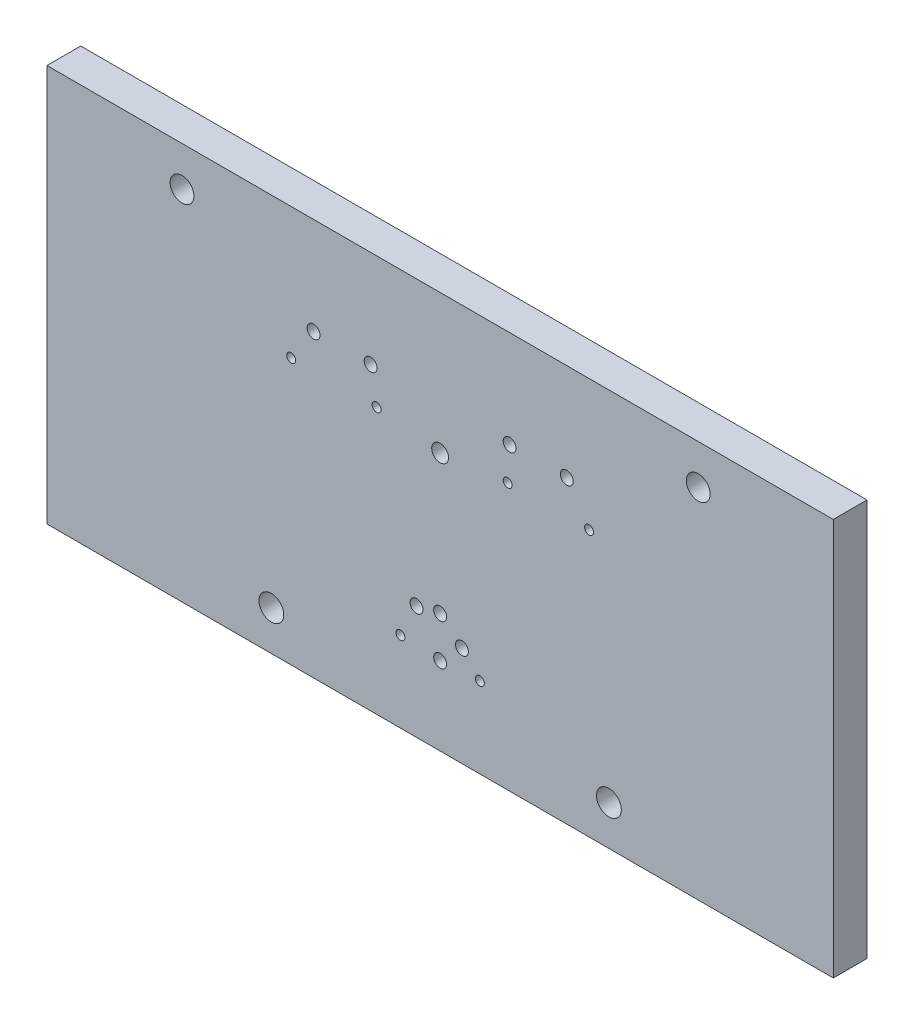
ISO-10303-21;
HEADER;
FILE_DESCRIPTION(('STEP AP214'),'2;1');
FILE_NAME('part.step','',(''),(''),'','','');
FILE_SCHEMA(('AUTOMOTIVE_DESIGN { 1 0 10303 214 1 1 1 1 }'));
ENDSEC;
DATA;
#1=APPLICATION_CONTEXT('core data for automotive mechanical design processes');
#2=APPLICATION_PROTOCOL_DEFINITION('international standard','automotive_design',2000,#1);
#3=PRODUCT_CONTEXT('',#1,'mechanical');
#4=PRODUCT('Part','Part','',(#3));
#5=PRODUCT_RELATED_PRODUCT_CATEGORY('part','',(#4));
#6=PRODUCT_DEFINITION_FORMATION('','',#4);
#7=PRODUCT_DEFINITION_CONTEXT('part definition',#1,'design');
#8=PRODUCT_DEFINITION('design','',#6,#7);
#9=PRODUCT_DEFINITION_SHAPE('','',#8);
#10=(LENGTH_UNIT() NAMED_UNIT(*) SI_UNIT(.MILLI.,.METRE.));
#11=(NAMED_UNIT(*) PLANE_ANGLE_UNIT() SI_UNIT($,.RADIAN.));
#12=(NAMED_UNIT(*) SI_UNIT($,.STERADIAN.) SOLID_ANGLE_UNIT());
#13=UNCERTAINTY_MEASURE_WITH_UNIT(LENGTH_MEASURE(1.E-05),#10,'distance_accuracy_value','');
#14=(GEOMETRIC_REPRESENTATION_CONTEXT(3) GLOBAL_UNCERTAINTY_ASSIGNED_CONTEXT((#13)) GLOBAL_UNIT_ASSIGNED_CONTEXT((#10,
#11,#12)) REPRESENTATION_CONTEXT('',''));
#15=CARTESIAN_POINT('',(0.,0.,0.));
#16=DIRECTION('',(0.,0.,1.));
#17=DIRECTION('',(1.,0.,0.));
#18=AXIS2_PLACEMENT_3D('',#15,#16,#17);
#19=CARTESIAN_POINT('',(8.02628908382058E-06,30.0000000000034,-143.));
#20=DIRECTION('',(0.,0.,1.));
#21=DIRECTION('',(1.,0.,0.));
#22=AXIS2_PLACEMENT_3D('',#19,#20,#21);
#23=CYLINDRICAL_SURFACE('',#22,4.25);
#24=CARTESIAN_POINT('',(8.02628908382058E-06,30.0000000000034,-126.));
#25=DIRECTION('',(0.,0.,1.));
#26=DIRECTION('',(1.,0.,0.));
#27=AXIS2_PLACEMENT_3D('',#24,#25,#26);
#28=CIRCLE('',#27,4.25);
#29=CARTESIAN_POINT('',(4.25000802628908,30.0000000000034,-126.));
#30=VERTEX_POINT('',#29);
#31=EDGE_CURVE('E478',#30,#30,#28,.T.);
#32=ORIENTED_EDGE('',*,*,#31,.T.);
#33=EDGE_LOOP('',(#32));
#34=FACE_BOUND('',#33,.T.);
#35=CARTESIAN_POINT('',(8.02628908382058E-06,30.0000000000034,-138.));
#36=DIRECTION('',(0.,0.,-1.));
#37=DIRECTION('',(-1.,0.,0.));
#38=AXIS2_PLACEMENT_3D('',#35,#36,#37);
#39=CIRCLE('',#38,4.25);
#40=CARTESIAN_POINT('',(-4.24999197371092,30.0000000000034,-138.));
#41=VERTEX_POINT('',#40);
#42=EDGE_CURVE('E38',#41,#41,#39,.F.);
#43=ORIENTED_EDGE('',*,*,#42,.F.);
#44=EDGE_LOOP('',(#43));
#45=FACE_BOUND('',#44,.T.);
#46=ADVANCED_FACE('F34',(#34,#45),#23,.F.);
#47=CARTESIAN_POINT('',(75.0000080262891,33.9924836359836,-143.));
#48=DIRECTION('',(0.,0.,1.));
#49=DIRECTION('',(1.,0.,0.));
#50=AXIS2_PLACEMENT_3D('',#47,#48,#49);
#51=CYLINDRICAL_SURFACE('',#50,2.25);
#52=CARTESIAN_POINT('',(75.0000080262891,33.9924836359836,-126.));
#53=DIRECTION('',(0.,0.,1.));
#54=DIRECTION('',(1.,0.,0.));
#55=AXIS2_PLACEMENT_3D('',#52,#53,#54);
#56=CIRCLE('',#55,2.25);
#57=CARTESIAN_POINT('',(77.2500080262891,33.9924836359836,-126.));
#58=VERTEX_POINT('',#57);
#59=EDGE_CURVE('E483',#58,#58,#56,.T.);
#60=ORIENTED_EDGE('',*,*,#59,.T.);
#61=EDGE_LOOP('',(#60));
#62=FACE_BOUND('',#61,.T.);
#63=CARTESIAN_POINT('',(75.0000080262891,33.9924836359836,-140.));
#64=DIRECTION('',(0.,0.,-1.));
#65=DIRECTION('',(-1.,0.,0.));
#66=AXIS2_PLACEMENT_3D('',#63,#64,#65);
#67=CIRCLE('',#66,2.25);
#68=CARTESIAN_POINT('',(72.7500080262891,33.9924836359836,-140.));
#69=VERTEX_POINT('',#68);
#70=EDGE_CURVE('E444',#69,#69,#67,.F.);
#71=ORIENTED_EDGE('',*,*,#70,.F.);
#72=EDGE_LOOP('',(#71));
#73=FACE_BOUND('',#72,.T.);
#74=ADVANCED_FACE('F113',(#62,#73),#51,.F.);
#75=CARTESIAN_POINT('',(34.0000080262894,33.9924836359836,-143.));
#76=DIRECTION('',(0.,0.,1.));
#77=DIRECTION('',(1.,0.,0.));
#78=AXIS2_PLACEMENT_3D('',#75,#76,#77);
#79=CYLINDRICAL_SURFACE('',#78,2.25);
#80=CARTESIAN_POINT('',(34.0000080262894,33.9924836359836,-126.));
#81=DIRECTION('',(0.,0.,1.));
#82=DIRECTION('',(1.,0.,0.));
#83=AXIS2_PLACEMENT_3D('',#80,#81,#82);
#84=CIRCLE('',#83,2.25);
#85=CARTESIAN_POINT('',(36.2500080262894,33.9924836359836,-126.));
#86=VERTEX_POINT('',#85);
#87=EDGE_CURVE('E480',#86,#86,#84,.T.);
#88=ORIENTED_EDGE('',*,*,#87,.T.);
#89=EDGE_LOOP('',(#88));
#90=FACE_BOUND('',#89,.T.);
#91=CARTESIAN_POINT('',(34.0000080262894,33.9924836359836,-140.));
#92=DIRECTION('',(0.,0.,-1.));
#93=DIRECTION('',(-1.,0.,0.));
#94=AXIS2_PLACEMENT_3D('',#91,#92,#93);
#95=CIRCLE('',#94,2.25);
#96=CARTESIAN_POINT('',(31.7500080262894,33.9924836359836,-140.));
#97=VERTEX_POINT('',#96);
#98=EDGE_CURVE('E440',#97,#97,#95,.F.);
#99=ORIENTED_EDGE('',*,*,#98,.F.);
#100=EDGE_LOOP('',(#99));
#101=FACE_BOUND('',#100,.T.);
#102=ADVANCED_FACE('F119',(#90,#101),#79,.F.);
#103=CARTESIAN_POINT('',(-31.9999919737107,33.9924836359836,-143.));
#104=DIRECTION('',(0.,0.,1.));
#105=DIRECTION('',(1.,0.,0.));
#106=AXIS2_PLACEMENT_3D('',#103,#104,#105);
#107=CYLINDRICAL_SURFACE('',#106,2.25);
#108=CARTESIAN_POINT('',(-31.9999919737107,33.9924836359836,-126.));
#109=DIRECTION('',(0.,0.,1.));
#110=DIRECTION('',(1.,0.,0.));
#111=AXIS2_PLACEMENT_3D('',#108,#109,#110);
#112=CIRCLE('',#111,2.25);
#113=CARTESIAN_POINT('',(-29.7499919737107,33.9924836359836,-126.));
#114=VERTEX_POINT('',#113);
#115=EDGE_CURVE('E475',#114,#114,#112,.T.);
#116=ORIENTED_EDGE('',*,*,#115,.T.);
#117=EDGE_LOOP('',(#116));
#118=FACE_BOUND('',#117,.T.);
#119=CARTESIAN_POINT('',(-31.9999919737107,33.9924836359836,-140.));
#120=DIRECTION('',(0.,0.,-1.));
#121=DIRECTION('',(-1.,0.,0.));
#122=AXIS2_PLACEMENT_3D('',#119,#120,#121);
#123=CIRCLE('',#122,2.25);
#124=CARTESIAN_POINT('',(-34.2499919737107,33.9924836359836,-140.));
#125=VERTEX_POINT('',#124);
#126=EDGE_CURVE('E435',#125,#125,#123,.F.);
#127=ORIENTED_EDGE('',*,*,#126,.F.);
#128=EDGE_LOOP('',(#127));
#129=FACE_BOUND('',#128,.T.);
#130=ADVANCED_FACE('F126',(#118,#129),#107,.F.);
#131=CARTESIAN_POINT('',(-74.9999919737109,33.9924836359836,-143.));
#132=DIRECTION('',(0.,0.,1.));
#133=DIRECTION('',(1.,0.,0.));
#134=AXIS2_PLACEMENT_3D('',#131,#132,#133);
#135=CYLINDRICAL_SURFACE('',#134,2.25);
#136=CARTESIAN_POINT('',(-74.9999919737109,33.9924836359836,-126.));
#137=DIRECTION('',(0.,0.,1.));
#138=DIRECTION('',(1.,0.,0.));
#139=AXIS2_PLACEMENT_3D('',#136,#137,#138);
#140=CIRCLE('',#139,2.25);
#141=CARTESIAN_POINT('',(-72.7499919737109,33.9924836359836,-126.));
#142=VERTEX_POINT('',#141);
#143=EDGE_CURVE('E433',#142,#142,#140,.T.);
#144=ORIENTED_EDGE('',*,*,#143,.T.);
#145=EDGE_LOOP('',(#144));
#146=FACE_BOUND('',#145,.T.);
#147=CARTESIAN_POINT('',(-74.9999919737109,33.9924836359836,-140.));
#148=DIRECTION('',(0.,0.,-1.));
#149=DIRECTION('',(-1.,0.,0.));
#150=AXIS2_PLACEMENT_3D('',#147,#148,#149);
#151=CIRCLE('',#150,2.25);
#152=CARTESIAN_POINT('',(-77.2499919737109,33.9924836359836,-140.));
#153=VERTEX_POINT('',#152);
#154=EDGE_CURVE('E430',#153,#153,#151,.F.);
#155=ORIENTED_EDGE('',*,*,#154,.F.);
#156=EDGE_LOOP('',(#155));
#157=FACE_BOUND('',#156,.T.);
#158=ADVANCED_FACE('F583',(#146,#157),#135,.F.);
#159=CARTESIAN_POINT('',(198.,-100.,-126.));
#160=DIRECTION('',(0.,0.,-1.));
#161=DIRECTION('',(-1.,0.,0.));
#162=AXIS2_PLACEMENT_3D('',#159,#160,#161);
#163=PLANE('',#162);
#164=ORIENTED_EDGE('',*,*,#143,.F.);
#165=EDGE_LOOP('',(#164));
#166=FACE_BOUND('',#165,.T.);
#167=ORIENTED_EDGE('',*,*,#115,.F.);
#168=EDGE_LOOP('',(#167));
#169=FACE_BOUND('',#168,.T.);
#170=ORIENTED_EDGE('',*,*,#31,.F.);
#171=EDGE_LOOP('',(#170));
#172=FACE_BOUND('',#171,.T.);
#173=ORIENTED_EDGE('',*,*,#87,.F.);
#174=EDGE_LOOP('',(#173));
#175=FACE_BOUND('',#174,.T.);
#176=ORIENTED_EDGE('',*,*,#59,.F.);
#177=EDGE_LOOP('',(#176));
#178=FACE_BOUND('',#177,.T.);
#179=CARTESIAN_POINT('',(-85.,-80.,-126.));
#180=DIRECTION('',(0.,0.,-1.));
#181=DIRECTION('',(-1.,0.,0.));
#182=AXIS2_PLACEMENT_3D('',#179,#180,#181);
#183=CIRCLE('',#182,6.25);
#184=CARTESIAN_POINT('',(-91.25,-80.,-126.));
#185=VERTEX_POINT('',#184);
#186=EDGE_CURVE('E429',#185,#185,#183,.T.);
#187=ORIENTED_EDGE('',*,*,#186,.T.);
#188=EDGE_LOOP('',(#187));
#189=FACE_BOUND('',#188,.T.);
#190=CARTESIAN_POINT('',(8.02628750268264E-06,-60.613025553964,-126.));
#191=DIRECTION('',(0.,0.,-1.));
#192=DIRECTION('',(-1.,0.,0.));
#193=AXIS2_PLACEMENT_3D('',#190,#191,#192);
#194=CIRCLE('',#193,3.25);
#195=CARTESIAN_POINT('',(-3.2499919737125,-60.613025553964,-126.));
#196=VERTEX_POINT('',#195);
#197=EDGE_CURVE('E421',#196,#196,#194,.T.);
#198=ORIENTED_EDGE('',*,*,#197,.T.);
#199=EDGE_LOOP('',(#198));
#200=FACE_BOUND('',#199,.T.);
#201=CARTESIAN_POINT('',(20.0000080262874,-59.4150083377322,-126.));
#202=DIRECTION('',(0.,0.,1.));
#203=DIRECTION('',(1.,0.,0.));
#204=AXIS2_PLACEMENT_3D('',#201,#202,#203);
#205=CIRCLE('',#204,2.25);
#206=CARTESIAN_POINT('',(22.2500080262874,-59.4150083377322,-126.));
#207=VERTEX_POINT('',#206);
#208=EDGE_CURVE('E417',#207,#207,#205,.T.);
#209=ORIENTED_EDGE('',*,*,#208,.F.);
#210=EDGE_LOOP('',(#209));
#211=FACE_BOUND('',#210,.T.);
#212=CARTESIAN_POINT('',(8.02628752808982E-06,-40.,-126.));
#213=DIRECTION('',(0.,0.,-1.));
#214=DIRECTION('',(-1.,0.,0.));
#215=AXIS2_PLACEMENT_3D('',#212,#213,#214);
#216=CIRCLE('',#215,3.25);
#217=CARTESIAN_POINT('',(-3.24999197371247,-40.,-126.));
#218=VERTEX_POINT('',#217);
#219=EDGE_CURVE('E409',#218,#218,#216,.T.);
#220=ORIENTED_EDGE('',*,*,#219,.T.);
#221=EDGE_LOOP('',(#220));
#222=FACE_BOUND('',#221,.T.);
#223=CARTESIAN_POINT('',(85.,-80.,-126.));
#224=DIRECTION('',(0.,0.,-1.));
#225=DIRECTION('',(-1.,0.,0.));
#226=AXIS2_PLACEMENT_3D('',#223,#224,#225);
#227=CIRCLE('',#226,6.25);
#228=CARTESIAN_POINT('',(78.75,-80.,-126.));
#229=VERTEX_POINT('',#228);
#230=EDGE_CURVE('E401',#229,#229,#227,.T.);
#231=ORIENTED_EDGE('',*,*,#230,.T.);
#232=EDGE_LOOP('',(#231));
#233=FACE_BOUND('',#232,.T.);
#234=CARTESIAN_POINT('',(-63.7499919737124,51.0956758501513,-126.));
#235=DIRECTION('',(0.,0.,1.));
#236=DIRECTION('',(1.,0.,0.));
#237=AXIS2_PLACEMENT_3D('',#234,#235,#236);
#238=CIRCLE('',#237,3.25);
#239=CARTESIAN_POINT('',(-60.4999919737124,51.0956758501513,-126.));
#240=VERTEX_POINT('',#239);
#241=EDGE_CURVE('E397',#240,#240,#238,.T.);
#242=ORIENTED_EDGE('',*,*,#241,.F.);
#243=EDGE_LOOP('',(#242));
#244=FACE_BOUND('',#243,.T.);
#245=CARTESIAN_POINT('',(-34.9999919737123,51.0956836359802,-126.));
#246=DIRECTION('',(0.,0.,1.));
#247=DIRECTION('',(1.,0.,0.));
#248=AXIS2_PLACEMENT_3D('',#245,#246,#247);
#249=CIRCLE('',#248,3.25);
#250=CARTESIAN_POINT('',(-31.7499919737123,51.0956836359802,-126.));
#251=VERTEX_POINT('',#250);
#252=EDGE_CURVE('E393',#251,#251,#249,.T.);
#253=ORIENTED_EDGE('',*,*,#252,.F.);
#254=EDGE_LOOP('',(#253));
#255=FACE_BOUND('',#254,.T.);
#256=CARTESIAN_POINT('',(35.0000080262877,51.0956836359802,-126.));
#257=DIRECTION('',(0.,0.,1.));
#258=DIRECTION('',(1.,0.,0.));
#259=AXIS2_PLACEMENT_3D('',#256,#257,#258);
#260=CIRCLE('',#259,3.25);
#261=CARTESIAN_POINT('',(38.2500080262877,51.0956836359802,-126.));
#262=VERTEX_POINT('',#261);
#263=EDGE_CURVE('E389',#262,#262,#260,.T.);
#264=ORIENTED_EDGE('',*,*,#263,.F.);
#265=EDGE_LOOP('',(#264));
#266=FACE_BOUND('',#265,.T.);
#267=CARTESIAN_POINT('',(63.7500080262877,51.0956758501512,-126.));
#268=DIRECTION('',(0.,0.,1.));
#269=DIRECTION('',(1.,0.,0.));
#270=AXIS2_PLACEMENT_3D('',#267,#268,#269);
#271=CIRCLE('',#270,3.25);
#272=CARTESIAN_POINT('',(67.0000080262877,51.0956758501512,-126.));
#273=VERTEX_POINT('',#272);
#274=EDGE_CURVE('E385',#273,#273,#271,.T.);
#275=ORIENTED_EDGE('',*,*,#274,.F.);
#276=EDGE_LOOP('',(#275));
#277=FACE_BOUND('',#276,.T.);
#278=CARTESIAN_POINT('',(130.,80.,-126.));
#279=DIRECTION('',(0.,0.,-1.));
#280=DIRECTION('',(-1.,0.,0.));
#281=AXIS2_PLACEMENT_3D('',#278,#279,#280);
#282=CIRCLE('',#281,6.);
#283=CARTESIAN_POINT('',(124.,80.,-126.));
#284=VERTEX_POINT('',#283);
#285=EDGE_CURVE('E333',#284,#284,#282,.T.);
#286=ORIENTED_EDGE('',*,*,#285,.T.);
#287=EDGE_LOOP('',(#286));
#288=FACE_BOUND('',#287,.T.);
#289=CARTESIAN_POINT('',(-130.,80.,-126.));
#290=DIRECTION('',(0.,0.,-1.));
#291=DIRECTION('',(-1.,0.,0.));
#292=AXIS2_PLACEMENT_3D('',#289,#290,#291);
#293=CIRCLE('',#292,6.);
#294=CARTESIAN_POINT('',(-136.,80.,-126.));
#295=VERTEX_POINT('',#294);
#296=EDGE_CURVE('E307',#295,#295,#293,.T.);
#297=ORIENTED_EDGE('',*,*,#296,.T.);
#298=EDGE_LOOP('',(#297));
#299=FACE_BOUND('',#298,.T.);
#300=DIRECTION('',(0.,-1.,0.));
#301=VECTOR('',#300,1.);
#302=CARTESIAN_POINT('',(198.,100.,-126.));
#303=LINE('',#302,#301);
#304=CARTESIAN_POINT('',(198.,100.,-126.));
#305=VERTEX_POINT('',#304);
#306=CARTESIAN_POINT('',(198.,-100.,-126.));
#307=VERTEX_POINT('',#306);
#308=EDGE_CURVE('E356',#305,#307,#303,.T.);
#309=ORIENTED_EDGE('',*,*,#308,.F.);
#310=DIRECTION('',(1.,0.,0.));
#311=VECTOR('',#310,1.);
#312=CARTESIAN_POINT('',(-198.,100.,-126.));
#313=LINE('',#312,#311);
#314=CARTESIAN_POINT('',(-198.,100.,-126.));
#315=VERTEX_POINT('',#314);
#316=EDGE_CURVE('E362',#315,#305,#313,.T.);
#317=ORIENTED_EDGE('',*,*,#316,.F.);
#318=DIRECTION('',(0.,1.,0.));
#319=VECTOR('',#318,1.);
#320=CARTESIAN_POINT('',(-198.,0.,-126.));
#321=LINE('',#320,#319);
#322=CARTESIAN_POINT('',(-198.,-100.,-126.));
#323=VERTEX_POINT('',#322);
#324=EDGE_CURVE('E70',#323,#315,#321,.T.);
#325=ORIENTED_EDGE('',*,*,#324,.F.);
#326=DIRECTION('',(-1.,0.,0.));
#327=VECTOR('',#326,1.);
#328=CARTESIAN_POINT('',(198.,-100.,-126.));
#329=LINE('',#328,#327);
#330=EDGE_CURVE('E369',#307,#323,#329,.T.);
#331=ORIENTED_EDGE('',*,*,#330,.F.);
#332=EDGE_LOOP('',(#309,#317,#325,#331));
#333=FACE_BOUND('',#332,.T.);
#334=CARTESIAN_POINT('',(-19.9999919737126,-59.4150083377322,-126.));
#335=DIRECTION('',(0.,0.,-1.));
#336=DIRECTION('',(-1.,0.,0.));
#337=AXIS2_PLACEMENT_3D('',#334,#335,#336);
#338=CIRCLE('',#337,2.25);
#339=CARTESIAN_POINT('',(-22.2499919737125,-59.4150083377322,-126.));
#340=VERTEX_POINT('',#339);
#341=EDGE_CURVE('E405',#340,#340,#338,.T.);
#342=ORIENTED_EDGE('',*,*,#341,.T.);
#343=EDGE_LOOP('',(#342));
#344=FACE_BOUND('',#343,.T.);
#345=CARTESIAN_POINT('',(10.9802916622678,-49.6229916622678,-126.));
#346=DIRECTION('',(0.,0.,-1.));
#347=DIRECTION('',(-1.,0.,0.));
#348=AXIS2_PLACEMENT_3D('',#345,#346,#347);
#349=CIRCLE('',#348,3.25);
#350=CARTESIAN_POINT('',(7.7302916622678,-49.6229916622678,-126.));
#351=VERTEX_POINT('',#350);
#352=EDGE_CURVE('E413',#351,#351,#349,.T.);
#353=ORIENTED_EDGE('',*,*,#352,.T.);
#354=EDGE_LOOP('',(#353));
#355=FACE_BOUND('',#354,.T.);
#356=CARTESIAN_POINT('',(-11.8955416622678,-42.687,-126.));
#357=DIRECTION('',(0.,0.,-1.));
#358=DIRECTION('',(-1.,0.,0.));
#359=AXIS2_PLACEMENT_3D('',#356,#357,#358);
#360=CIRCLE('',#359,3.25);
#361=CARTESIAN_POINT('',(-15.1455416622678,-42.687,-126.));
#362=VERTEX_POINT('',#361);
#363=EDGE_CURVE('E425',#362,#362,#360,.T.);
#364=ORIENTED_EDGE('',*,*,#363,.T.);
#365=EDGE_LOOP('',(#364));
#366=FACE_BOUND('',#365,.T.);
#367=ADVANCED_FACE('F265',(#166,#169,#172,#175,#178,#189,#200,#211,#222,#233,#244,#255,#266,
#277,#288,#299,#333,#344,#355,#366),#163,.F.);
#368=CARTESIAN_POINT('',(198.,-100.,-136.));
#369=DIRECTION('',(0.,0.,-1.));
#370=DIRECTION('',(-1.,0.,0.));
#371=AXIS2_PLACEMENT_3D('',#368,#369,#370);
#372=PLANE('',#371);
#373=CARTESIAN_POINT('',(-85.,-80.,-136.));
#374=DIRECTION('',(0.,0.,-1.));
#375=DIRECTION('',(-1.,0.,0.));
#376=AXIS2_PLACEMENT_3D('',#373,#374,#375);
#377=CIRCLE('',#376,9.);
#378=CARTESIAN_POINT('',(-94.,-80.,-136.));
#379=VERTEX_POINT('',#378);
#380=EDGE_CURVE('E567',#379,#379,#377,.F.);
#381=ORIENTED_EDGE('',*,*,#380,.F.);
#382=EDGE_LOOP('',(#381));
#383=FACE_BOUND('',#382,.T.);
#384=CARTESIAN_POINT('',(-85.,-80.,-136.));
#385=DIRECTION('',(0.,0.,-1.));
#386=DIRECTION('',(-1.,0.,0.));
#387=AXIS2_PLACEMENT_3D('',#384,#385,#386);
#388=CIRCLE('',#387,6.25);
#389=CARTESIAN_POINT('',(-91.25,-80.,-136.));
#390=VERTEX_POINT('',#389);
#391=EDGE_CURVE('E426',#390,#390,#388,.F.);
#392=ORIENTED_EDGE('',*,*,#391,.T.);
#393=EDGE_LOOP('',(#392));
#394=FACE_BOUND('',#393,.T.);
#395=ADVANCED_FACE('F217',(#383,#394),#372,.T.);
#396=CARTESIAN_POINT('',(-11.8955416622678,-42.687,-138.));
#397=DIRECTION('',(0.,0.,1.));
#398=DIRECTION('',(1.,0.,0.));
#399=AXIS2_PLACEMENT_3D('',#396,#397,#398);
#400=PLANE('',#399);
#401=CARTESIAN_POINT('',(-11.8955416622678,-42.687,-138.));
#402=DIRECTION('',(0.,0.,1.));
#403=DIRECTION('',(1.,0.,0.));
#404=AXIS2_PLACEMENT_3D('',#401,#402,#403);
#405=CIRCLE('',#404,6.);
#406=CARTESIAN_POINT('',(-5.89554166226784,-42.687,-138.));
#407=VERTEX_POINT('',#406);
#408=EDGE_CURVE('E534',#407,#407,#405,.T.);
#409=ORIENTED_EDGE('',*,*,#408,.F.);
#410=EDGE_LOOP('',(#409));
#411=FACE_BOUND('',#410,.T.);
#412=CARTESIAN_POINT('',(-11.8955416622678,-42.687,-138.));
#413=DIRECTION('',(0.,0.,1.));
#414=DIRECTION('',(1.,0.,0.));
#415=AXIS2_PLACEMENT_3D('',#412,#413,#414);
#416=CIRCLE('',#415,3.25);
#417=CARTESIAN_POINT('',(-8.64554166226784,-42.687,-138.));
#418=VERTEX_POINT('',#417);
#419=EDGE_CURVE('E422',#418,#418,#416,.F.);
#420=ORIENTED_EDGE('',*,*,#419,.F.);
#421=EDGE_LOOP('',(#420));
#422=FACE_BOUND('',#421,.T.);
#423=ADVANCED_FACE('F213',(#411,#422),#400,.F.);
#424=CARTESIAN_POINT('',(8.02628750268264E-06,-60.613025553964,-138.));
#425=DIRECTION('',(0.,0.,1.));
#426=DIRECTION('',(1.,0.,0.));
#427=AXIS2_PLACEMENT_3D('',#424,#425,#426);
#428=PLANE('',#427);
#429=CARTESIAN_POINT('',(8.02628750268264E-06,-60.613025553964,-138.));
#430=DIRECTION('',(0.,0.,1.));
#431=DIRECTION('',(1.,0.,0.));
#432=AXIS2_PLACEMENT_3D('',#429,#430,#431);
#433=CIRCLE('',#432,6.);
#434=CARTESIAN_POINT('',(6.0000080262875,-60.613025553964,-138.));
#435=VERTEX_POINT('',#434);
#436=EDGE_CURVE('E558',#435,#435,#433,.T.);
#437=ORIENTED_EDGE('',*,*,#436,.F.);
#438=EDGE_LOOP('',(#437));
#439=FACE_BOUND('',#438,.T.);
#440=CARTESIAN_POINT('',(8.02628750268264E-06,-60.613025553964,-138.));
#441=DIRECTION('',(0.,0.,1.));
#442=DIRECTION('',(1.,0.,0.));
#443=AXIS2_PLACEMENT_3D('',#440,#441,#442);
#444=CIRCLE('',#443,3.25);
#445=CARTESIAN_POINT('',(3.2500080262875,-60.613025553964,-138.));
#446=VERTEX_POINT('',#445);
#447=EDGE_CURVE('E418',#446,#446,#444,.F.);
#448=ORIENTED_EDGE('',*,*,#447,.F.);
#449=EDGE_LOOP('',(#448));
#450=FACE_BOUND('',#449,.T.);
#451=ADVANCED_FACE('F216',(#439,#450),#428,.F.);
#452=CARTESIAN_POINT('',(10.9802916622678,-49.6229916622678,-138.));
#453=DIRECTION('',(0.,0.,1.));
#454=DIRECTION('',(1.,0.,0.));
#455=AXIS2_PLACEMENT_3D('',#452,#453,#454);
#456=PLANE('',#455);
#457=CARTESIAN_POINT('',(10.9802916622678,-49.6229916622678,-138.));
#458=DIRECTION('',(0.,0.,1.));
#459=DIRECTION('',(1.,0.,0.));
#460=AXIS2_PLACEMENT_3D('',#457,#458,#459);
#461=CIRCLE('',#460,6.);
#462=CARTESIAN_POINT('',(16.9802916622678,-49.6229916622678,-138.));
#463=VERTEX_POINT('',#462);
#464=EDGE_CURVE('E546',#463,#463,#461,.T.);
#465=ORIENTED_EDGE('',*,*,#464,.F.);
#466=EDGE_LOOP('',(#465));
#467=FACE_BOUND('',#466,.T.);
#468=CARTESIAN_POINT('',(10.9802916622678,-49.6229916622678,-138.));
#469=DIRECTION('',(0.,0.,1.));
#470=DIRECTION('',(1.,0.,0.));
#471=AXIS2_PLACEMENT_3D('',#468,#469,#470);
#472=CIRCLE('',#471,3.25);
#473=CARTESIAN_POINT('',(14.2302916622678,-49.6229916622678,-138.));
#474=VERTEX_POINT('',#473);
#475=EDGE_CURVE('E410',#474,#474,#472,.F.);
#476=ORIENTED_EDGE('',*,*,#475,.F.);
#477=EDGE_LOOP('',(#476));
#478=FACE_BOUND('',#477,.T.);
#479=ADVANCED_FACE('F227',(#467,#478),#456,.F.);
#480=CARTESIAN_POINT('',(8.02628752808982E-06,-40.,-138.));
#481=DIRECTION('',(0.,0.,-1.));
#482=DIRECTION('',(-1.,0.,0.));
#483=AXIS2_PLACEMENT_3D('',#480,#481,#482);
#484=PLANE('',#483);
#485=CARTESIAN_POINT('',(8.02628752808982E-06,-40.,-138.));
#486=DIRECTION('',(0.,0.,-1.));
#487=DIRECTION('',(-1.,0.,0.));
#488=AXIS2_PLACEMENT_3D('',#485,#486,#487);
#489=CIRCLE('',#488,6.);
#490=CARTESIAN_POINT('',(-5.99999197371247,-40.,-138.));
#491=VERTEX_POINT('',#490);
#492=EDGE_CURVE('E540',#491,#491,#489,.T.);
#493=ORIENTED_EDGE('',*,*,#492,.T.);
#494=EDGE_LOOP('',(#493));
#495=FACE_BOUND('',#494,.T.);
#496=CARTESIAN_POINT('',(8.02628752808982E-06,-40.,-138.));
#497=DIRECTION('',(0.,0.,-1.));
#498=DIRECTION('',(-1.,0.,0.));
#499=AXIS2_PLACEMENT_3D('',#496,#497,#498);
#500=CIRCLE('',#499,3.25);
#501=CARTESIAN_POINT('',(-3.24999197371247,-40.,-138.));
#502=VERTEX_POINT('',#501);
#503=EDGE_CURVE('E406',#502,#502,#500,.F.);
#504=ORIENTED_EDGE('',*,*,#503,.T.);
#505=EDGE_LOOP('',(#504));
#506=FACE_BOUND('',#505,.T.);
#507=ADVANCED_FACE('F223',(#495,#506),#484,.T.);
#508=CARTESIAN_POINT('',(-19.9999919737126,-59.4150083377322,-140.));
#509=DIRECTION('',(0.,0.,1.));
#510=DIRECTION('',(1.,0.,0.));
#511=AXIS2_PLACEMENT_3D('',#508,#509,#510);
#512=PLANE('',#511);
#513=CARTESIAN_POINT('',(-19.9999919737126,-59.4150083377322,-140.));
#514=DIRECTION('',(0.,0.,1.));
#515=DIRECTION('',(1.,0.,0.));
#516=AXIS2_PLACEMENT_3D('',#513,#514,#515);
#517=CIRCLE('',#516,4.);
#518=CARTESIAN_POINT('',(-15.9999919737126,-59.4150083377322,-140.));
#519=VERTEX_POINT('',#518);
#520=EDGE_CURVE('E564',#519,#519,#517,.T.);
#521=ORIENTED_EDGE('',*,*,#520,.F.);
#522=EDGE_LOOP('',(#521));
#523=FACE_BOUND('',#522,.T.);
#524=CARTESIAN_POINT('',(-19.9999919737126,-59.4150083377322,-140.));
#525=DIRECTION('',(0.,0.,1.));
#526=DIRECTION('',(1.,0.,0.));
#527=AXIS2_PLACEMENT_3D('',#524,#525,#526);
#528=CIRCLE('',#527,2.25);
#529=CARTESIAN_POINT('',(-17.7499919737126,-59.4150083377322,-140.));
#530=VERTEX_POINT('',#529);
#531=EDGE_CURVE('E402',#530,#530,#528,.F.);
#532=ORIENTED_EDGE('',*,*,#531,.F.);
#533=EDGE_LOOP('',(#532));
#534=FACE_BOUND('',#533,.T.);
#535=ADVANCED_FACE('F226',(#523,#534),#512,.F.);
#536=CARTESIAN_POINT('',(198.,-100.,-136.));
#537=DIRECTION('',(0.,0.,-1.));
#538=DIRECTION('',(-1.,0.,0.));
#539=AXIS2_PLACEMENT_3D('',#536,#537,#538);
#540=PLANE('',#539);
#541=CARTESIAN_POINT('',(85.,-80.,-136.));
#542=DIRECTION('',(0.,0.,-1.));
#543=DIRECTION('',(-1.,0.,0.));
#544=AXIS2_PLACEMENT_3D('',#541,#542,#543);
#545=CIRCLE('',#544,9.);
#546=CARTESIAN_POINT('',(76.,-80.,-136.));
#547=VERTEX_POINT('',#546);
#548=EDGE_CURVE('E311',#547,#547,#545,.F.);
#549=ORIENTED_EDGE('',*,*,#548,.F.);
#550=EDGE_LOOP('',(#549));
#551=FACE_BOUND('',#550,.T.);
#552=CARTESIAN_POINT('',(85.,-80.,-136.));
#553=DIRECTION('',(0.,0.,-1.));
#554=DIRECTION('',(-1.,0.,0.));
#555=AXIS2_PLACEMENT_3D('',#552,#553,#554);
#556=CIRCLE('',#555,6.25);
#557=CARTESIAN_POINT('',(78.75,-80.,-136.));
#558=VERTEX_POINT('',#557);
#559=EDGE_CURVE('E398',#558,#558,#556,.F.);
#560=ORIENTED_EDGE('',*,*,#559,.T.);
#561=EDGE_LOOP('',(#560));
#562=FACE_BOUND('',#561,.T.);
#563=ADVANCED_FACE('F257',(#551,#562),#540,.T.);
#564=CARTESIAN_POINT('',(198.,-100.,-143.));
#565=DIRECTION('',(0.,0.,-1.));
#566=DIRECTION('',(-1.,0.,0.));
#567=AXIS2_PLACEMENT_3D('',#564,#565,#566);
#568=PLANE('',#567);
#569=CARTESIAN_POINT('',(8.02628908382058E-06,30.0000000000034,-143.));
#570=DIRECTION('',(0.,0.,-1.));
#571=DIRECTION('',(-1.,0.,0.));
#572=AXIS2_PLACEMENT_3D('',#569,#570,#571);
#573=CIRCLE('',#572,6.);
#574=CARTESIAN_POINT('',(-5.99999197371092,30.0000000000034,-143.));
#575=VERTEX_POINT('',#574);
#576=EDGE_CURVE('E460',#575,#575,#573,.T.);
#577=ORIENTED_EDGE('',*,*,#576,.F.);
#578=EDGE_LOOP('',(#577));
#579=FACE_BOUND('',#578,.T.);
#580=CARTESIAN_POINT('',(75.0000080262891,33.9924836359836,-143.));
#581=DIRECTION('',(0.,0.,-1.));
#582=DIRECTION('',(-1.,0.,0.));
#583=AXIS2_PLACEMENT_3D('',#580,#581,#582);
#584=CIRCLE('',#583,4.00000000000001);
#585=CARTESIAN_POINT('',(71.0000080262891,33.9924836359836,-143.));
#586=VERTEX_POINT('',#585);
#587=EDGE_CURVE('E453',#586,#586,#584,.T.);
#588=ORIENTED_EDGE('',*,*,#587,.F.);
#589=EDGE_LOOP('',(#588));
#590=FACE_BOUND('',#589,.T.);
#591=CARTESIAN_POINT('',(34.0000080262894,33.9924836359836,-143.));
#592=DIRECTION('',(0.,0.,-1.));
#593=DIRECTION('',(-1.,0.,0.));
#594=AXIS2_PLACEMENT_3D('',#591,#592,#593);
#595=CIRCLE('',#594,4.);
#596=CARTESIAN_POINT('',(30.0000080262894,33.9924836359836,-143.));
#597=VERTEX_POINT('',#596);
#598=EDGE_CURVE('E446',#597,#597,#595,.T.);
#599=ORIENTED_EDGE('',*,*,#598,.F.);
#600=EDGE_LOOP('',(#599));
#601=FACE_BOUND('',#600,.T.);
#602=CARTESIAN_POINT('',(-31.9999919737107,33.9924836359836,-143.));
#603=DIRECTION('',(0.,0.,-1.));
#604=DIRECTION('',(-1.,0.,0.));
#605=AXIS2_PLACEMENT_3D('',#602,#603,#604);
#606=CIRCLE('',#605,4.);
#607=CARTESIAN_POINT('',(-35.9999919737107,33.9924836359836,-143.));
#608=VERTEX_POINT('',#607);
#609=EDGE_CURVE('E442',#608,#608,#606,.T.);
#610=ORIENTED_EDGE('',*,*,#609,.F.);
#611=EDGE_LOOP('',(#610));
#612=FACE_BOUND('',#611,.T.);
#613=CARTESIAN_POINT('',(-74.9999919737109,33.9924836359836,-143.));
#614=DIRECTION('',(0.,0.,-1.));
#615=DIRECTION('',(-1.,0.,0.));
#616=AXIS2_PLACEMENT_3D('',#613,#614,#615);
#617=CIRCLE('',#616,4.00000000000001);
#618=CARTESIAN_POINT('',(-78.9999919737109,33.9924836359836,-143.));
#619=VERTEX_POINT('',#618);
#620=EDGE_CURVE('E438',#619,#619,#617,.T.);
#621=ORIENTED_EDGE('',*,*,#620,.F.);
#622=EDGE_LOOP('',(#621));
#623=FACE_BOUND('',#622,.T.);
#624=CARTESIAN_POINT('',(-11.8955416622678,-42.687,-143.));
#625=DIRECTION('',(0.,0.,1.));
#626=DIRECTION('',(1.,0.,0.));
#627=AXIS2_PLACEMENT_3D('',#624,#625,#626);
#628=CIRCLE('',#627,6.);
#629=CARTESIAN_POINT('',(-5.89554166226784,-42.687,-143.));
#630=VERTEX_POINT('',#629);
#631=EDGE_CURVE('E531',#630,#630,#628,.T.);
#632=ORIENTED_EDGE('',*,*,#631,.T.);
#633=EDGE_LOOP('',(#632));
#634=FACE_BOUND('',#633,.T.);
#635=CARTESIAN_POINT('',(8.02628752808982E-06,-40.,-143.));
#636=DIRECTION('',(0.,0.,-1.));
#637=DIRECTION('',(-1.,0.,0.));
#638=AXIS2_PLACEMENT_3D('',#635,#636,#637);
#639=CIRCLE('',#638,6.);
#640=CARTESIAN_POINT('',(-5.99999197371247,-40.,-143.));
#641=VERTEX_POINT('',#640);
#642=EDGE_CURVE('E537',#641,#641,#639,.T.);
#643=ORIENTED_EDGE('',*,*,#642,.F.);
#644=EDGE_LOOP('',(#643));
#645=FACE_BOUND('',#644,.T.);
#646=CARTESIAN_POINT('',(20.0000080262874,-59.4150083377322,-143.));
#647=DIRECTION('',(0.,0.,1.));
#648=DIRECTION('',(1.,0.,0.));
#649=AXIS2_PLACEMENT_3D('',#646,#647,#648);
#650=CIRCLE('',#649,4.);
#651=CARTESIAN_POINT('',(24.0000080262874,-59.4150083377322,-143.));
#652=VERTEX_POINT('',#651);
#653=EDGE_CURVE('E549',#652,#652,#650,.T.);
#654=ORIENTED_EDGE('',*,*,#653,.T.);
#655=EDGE_LOOP('',(#654));
#656=FACE_BOUND('',#655,.T.);
#657=CARTESIAN_POINT('',(-19.9999919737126,-59.4150083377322,-143.));
#658=DIRECTION('',(0.,0.,1.));
#659=DIRECTION('',(1.,0.,0.));
#660=AXIS2_PLACEMENT_3D('',#657,#658,#659);
#661=CIRCLE('',#660,4.);
#662=CARTESIAN_POINT('',(-15.9999919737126,-59.4150083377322,-143.));
#663=VERTEX_POINT('',#662);
#664=EDGE_CURVE('E561',#663,#663,#661,.T.);
#665=ORIENTED_EDGE('',*,*,#664,.T.);
#666=EDGE_LOOP('',(#665));
#667=FACE_BOUND('',#666,.T.);
#668=CARTESIAN_POINT('',(-85.,-80.,-143.));
#669=DIRECTION('',(0.,0.,-1.));
#670=DIRECTION('',(-1.,0.,0.));
#671=AXIS2_PLACEMENT_3D('',#668,#669,#670);
#672=CIRCLE('',#671,9.);
#673=CARTESIAN_POINT('',(-94.,-80.,-143.));
#674=VERTEX_POINT('',#673);
#675=EDGE_CURVE('E570',#674,#674,#672,.F.);
#676=ORIENTED_EDGE('',*,*,#675,.T.);
#677=EDGE_LOOP('',(#676));
#678=FACE_BOUND('',#677,.T.);
#679=CARTESIAN_POINT('',(85.,-80.,-143.));
#680=DIRECTION('',(0.,0.,-1.));
#681=DIRECTION('',(-1.,0.,0.));
#682=AXIS2_PLACEMENT_3D('',#679,#680,#681);
#683=CIRCLE('',#682,9.);
#684=CARTESIAN_POINT('',(76.,-80.,-143.));
#685=VERTEX_POINT('',#684);
#686=EDGE_CURVE('E315',#685,#685,#683,.F.);
#687=ORIENTED_EDGE('',*,*,#686,.T.);
#688=EDGE_LOOP('',(#687));
#689=FACE_BOUND('',#688,.T.);
#690=DIRECTION('',(0.,-1.,0.));
#691=VECTOR('',#690,1.);
#692=CARTESIAN_POINT('',(198.,100.,-143.));
#693=LINE('',#692,#691);
#694=CARTESIAN_POINT('',(198.,100.,-143.));
#695=VERTEX_POINT('',#694);
#696=CARTESIAN_POINT('',(198.,-100.,-143.));
#697=VERTEX_POINT('',#696);
#698=EDGE_CURVE('E359',#695,#697,#693,.T.);
#699=ORIENTED_EDGE('',*,*,#698,.T.);
#700=DIRECTION('',(-1.,0.,0.));
#701=VECTOR('',#700,1.);
#702=CARTESIAN_POINT('',(198.,-100.,-143.));
#703=LINE('',#702,#701);
#704=CARTESIAN_POINT('',(-198.,-100.,-143.));
#705=VERTEX_POINT('',#704);
#706=EDGE_CURVE('E361',#697,#705,#703,.T.);
#707=ORIENTED_EDGE('',*,*,#706,.T.);
#708=DIRECTION('',(0.,1.,0.));
#709=VECTOR('',#708,1.);
#710=CARTESIAN_POINT('',(-198.,-100.,-143.));
#711=LINE('',#710,#709);
#712=CARTESIAN_POINT('',(-198.,100.,-143.));
#713=VERTEX_POINT('',#712);
#714=EDGE_CURVE('E53',#705,#713,#711,.T.);
#715=ORIENTED_EDGE('',*,*,#714,.T.);
#716=DIRECTION('',(1.,0.,0.));
#717=VECTOR('',#716,1.);
#718=CARTESIAN_POINT('',(-198.,100.,-143.));
#719=LINE('',#718,#717);
#720=EDGE_CURVE('E79',#713,#695,#719,.T.);
#721=ORIENTED_EDGE('',*,*,#720,.T.);
#722=EDGE_LOOP('',(#699,#707,#715,#721));
#723=FACE_BOUND('',#722,.T.);
#724=CARTESIAN_POINT('',(-182.,88.,-143.));
#725=DIRECTION('',(0.,0.,1.));
#726=DIRECTION('',(1.,0.,0.));
#727=AXIS2_PLACEMENT_3D('',#724,#725,#726);
#728=CIRCLE('',#727,4.);
#729=CARTESIAN_POINT('',(-178.,88.,-143.));
#730=VERTEX_POINT('',#729);
#731=EDGE_CURVE('E350',#730,#730,#728,.T.);
#732=ORIENTED_EDGE('',*,*,#731,.T.);
#733=EDGE_LOOP('',(#732));
#734=FACE_BOUND('',#733,.T.);
#735=CARTESIAN_POINT('',(182.,88.,-143.));
#736=DIRECTION('',(0.,0.,1.));
#737=DIRECTION('',(1.,0.,0.));
#738=AXIS2_PLACEMENT_3D('',#735,#736,#737);
#739=CIRCLE('',#738,4.);
#740=CARTESIAN_POINT('',(186.,88.,-143.));
#741=VERTEX_POINT('',#740);
#742=EDGE_CURVE('E344',#741,#741,#739,.T.);
#743=ORIENTED_EDGE('',*,*,#742,.T.);
#744=EDGE_LOOP('',(#743));
#745=FACE_BOUND('',#744,.T.);
#746=CARTESIAN_POINT('',(-182.,-88.,-143.));
#747=DIRECTION('',(0.,0.,1.));
#748=DIRECTION('',(1.,0.,0.));
#749=AXIS2_PLACEMENT_3D('',#746,#747,#748);
#750=CIRCLE('',#749,4.);
#751=CARTESIAN_POINT('',(-178.,-88.,-143.));
#752=VERTEX_POINT('',#751);
#753=EDGE_CURVE('E337',#752,#752,#750,.T.);
#754=ORIENTED_EDGE('',*,*,#753,.T.);
#755=EDGE_LOOP('',(#754));
#756=FACE_BOUND('',#755,.T.);
#757=CARTESIAN_POINT('',(182.,-88.,-143.));
#758=DIRECTION('',(0.,0.,1.));
#759=DIRECTION('',(1.,0.,0.));
#760=AXIS2_PLACEMENT_3D('',#757,#758,#759);
#761=CIRCLE('',#760,4.);
#762=CARTESIAN_POINT('',(186.,-88.,-143.));
#763=VERTEX_POINT('',#762);
#764=EDGE_CURVE('E338',#763,#763,#761,.T.);
#765=ORIENTED_EDGE('',*,*,#764,.T.);
#766=EDGE_LOOP('',(#765));
#767=FACE_BOUND('',#766,.T.);
#768=CARTESIAN_POINT('',(130.,80.,-143.));
#769=DIRECTION('',(0.,0.,-1.));
#770=DIRECTION('',(-1.,0.,0.));
#771=AXIS2_PLACEMENT_3D('',#768,#769,#770);
#772=CIRCLE('',#771,9.);
#773=CARTESIAN_POINT('',(121.,80.,-143.));
#774=VERTEX_POINT('',#773);
#775=EDGE_CURVE('E325',#774,#774,#772,.F.);
#776=ORIENTED_EDGE('',*,*,#775,.T.);
#777=EDGE_LOOP('',(#776));
#778=FACE_BOUND('',#777,.T.);
#779=CARTESIAN_POINT('',(-130.,80.,-143.));
#780=DIRECTION('',(0.,0.,-1.));
#781=DIRECTION('',(-1.,0.,0.));
#782=AXIS2_PLACEMENT_3D('',#779,#780,#781);
#783=CIRCLE('',#782,9.);
#784=CARTESIAN_POINT('',(-139.,80.,-143.));
#785=VERTEX_POINT('',#784);
#786=EDGE_CURVE('E312',#785,#785,#783,.F.);
#787=ORIENTED_EDGE('',*,*,#786,.T.);
#788=EDGE_LOOP('',(#787));
#789=FACE_BOUND('',#788,.T.);
#790=CARTESIAN_POINT('',(8.02628750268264E-06,-60.613025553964,-143.));
#791=DIRECTION('',(0.,0.,1.));
#792=DIRECTION('',(1.,0.,0.));
#793=AXIS2_PLACEMENT_3D('',#790,#791,#792);
#794=CIRCLE('',#793,6.);
#795=CARTESIAN_POINT('',(6.0000080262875,-60.613025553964,-143.));
#796=VERTEX_POINT('',#795);
#797=EDGE_CURVE('E555',#796,#796,#794,.T.);
#798=ORIENTED_EDGE('',*,*,#797,.T.);
#799=EDGE_LOOP('',(#798));
#800=FACE_BOUND('',#799,.T.);
#801=CARTESIAN_POINT('',(10.9802916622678,-49.6229916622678,-143.));
#802=DIRECTION('',(0.,0.,1.));
#803=DIRECTION('',(1.,0.,0.));
#804=AXIS2_PLACEMENT_3D('',#801,#802,#803);
#805=CIRCLE('',#804,6.);
#806=CARTESIAN_POINT('',(16.9802916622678,-49.6229916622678,-143.));
#807=VERTEX_POINT('',#806);
#808=EDGE_CURVE('E543',#807,#807,#805,.T.);
#809=ORIENTED_EDGE('',*,*,#808,.T.);
#810=EDGE_LOOP('',(#809));
#811=FACE_BOUND('',#810,.T.);
#812=CARTESIAN_POINT('',(-63.7499919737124,51.0956758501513,-143.));
#813=DIRECTION('',(0.,0.,-1.));
#814=DIRECTION('',(-1.,0.,0.));
#815=AXIS2_PLACEMENT_3D('',#812,#813,#814);
#816=CIRCLE('',#815,6.);
#817=CARTESIAN_POINT('',(-69.7499919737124,51.0956758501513,-143.));
#818=VERTEX_POINT('',#817);
#819=EDGE_CURVE('E525',#818,#818,#816,.T.);
#820=ORIENTED_EDGE('',*,*,#819,.F.);
#821=EDGE_LOOP('',(#820));
#822=FACE_BOUND('',#821,.T.);
#823=CARTESIAN_POINT('',(63.7500080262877,51.0956758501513,-143.));
#824=DIRECTION('',(0.,0.,-1.));
#825=DIRECTION('',(-1.,0.,0.));
#826=AXIS2_PLACEMENT_3D('',#823,#824,#825);
#827=CIRCLE('',#826,6.);
#828=CARTESIAN_POINT('',(57.7500080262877,51.0956758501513,-143.));
#829=VERTEX_POINT('',#828);
#830=EDGE_CURVE('E519',#829,#829,#827,.T.);
#831=ORIENTED_EDGE('',*,*,#830,.F.);
#832=EDGE_LOOP('',(#831));
#833=FACE_BOUND('',#832,.T.);
#834=CARTESIAN_POINT('',(-34.9999919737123,51.0956836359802,-143.));
#835=DIRECTION('',(0.,0.,-1.));
#836=DIRECTION('',(-1.,0.,0.));
#837=AXIS2_PLACEMENT_3D('',#834,#835,#836);
#838=CIRCLE('',#837,6.);
#839=CARTESIAN_POINT('',(-40.9999919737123,51.0956836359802,-143.));
#840=VERTEX_POINT('',#839);
#841=EDGE_CURVE('E513',#840,#840,#838,.T.);
#842=ORIENTED_EDGE('',*,*,#841,.F.);
#843=EDGE_LOOP('',(#842));
#844=FACE_BOUND('',#843,.T.);
#845=CARTESIAN_POINT('',(35.0000080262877,51.0956836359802,-143.));
#846=DIRECTION('',(0.,0.,-1.));
#847=DIRECTION('',(-1.,0.,0.));
#848=AXIS2_PLACEMENT_3D('',#845,#846,#847);
#849=CIRCLE('',#848,6.);
#850=CARTESIAN_POINT('',(29.0000080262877,51.0956836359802,-143.));
#851=VERTEX_POINT('',#850);
#852=EDGE_CURVE('E384',#851,#851,#849,.T.);
#853=ORIENTED_EDGE('',*,*,#852,.F.);
#854=EDGE_LOOP('',(#853));
#855=FACE_BOUND('',#854,.T.);
#856=ADVANCED_FACE('F281',(#579,#590,#601,#612,#623,#634,#645,#656,#667,#678,#689,#723,#734,
#745,#756,#767,#778,#789,#800,#811,#822,#833,#844,#855),#568,.T.);
#857=CARTESIAN_POINT('',(-130.,80.,-1415.7));
#858=DIRECTION('',(0.,0.,1.));
#859=DIRECTION('',(1.,0.,0.));
#860=AXIS2_PLACEMENT_3D('',#857,#858,#859);
#861=CYLINDRICAL_SURFACE('',#860,6.);
#862=ORIENTED_EDGE('',*,*,#296,.F.);
#863=EDGE_LOOP('',(#862));
#864=FACE_BOUND('',#863,.T.);
#865=CARTESIAN_POINT('',(-130.,80.,-136.));
#866=DIRECTION('',(0.,0.,-1.));
#867=DIRECTION('',(-1.,0.,0.));
#868=AXIS2_PLACEMENT_3D('',#865,#866,#867);
#869=CIRCLE('',#868,6.);
#870=CARTESIAN_POINT('',(-136.,80.,-136.));
#871=VERTEX_POINT('',#870);
#872=EDGE_CURVE('E310',#871,#871,#869,.F.);
#873=ORIENTED_EDGE('',*,*,#872,.F.);
#874=EDGE_LOOP('',(#873));
#875=FACE_BOUND('',#874,.T.);
#876=ADVANCED_FACE('F295',(#864,#875),#861,.F.);
#877=CARTESIAN_POINT('',(130.,80.,-1415.7));
#878=DIRECTION('',(0.,0.,1.));
#879=DIRECTION('',(1.,0.,0.));
#880=AXIS2_PLACEMENT_3D('',#877,#878,#879);
#881=CYLINDRICAL_SURFACE('',#880,6.);
#882=ORIENTED_EDGE('',*,*,#285,.F.);
#883=EDGE_LOOP('',(#882));
#884=FACE_BOUND('',#883,.T.);
#885=CARTESIAN_POINT('',(130.,80.,-136.));
#886=DIRECTION('',(0.,0.,-1.));
#887=DIRECTION('',(-1.,0.,0.));
#888=AXIS2_PLACEMENT_3D('',#885,#886,#887);
#889=CIRCLE('',#888,6.);
#890=CARTESIAN_POINT('',(124.,80.,-136.));
#891=VERTEX_POINT('',#890);
#892=EDGE_CURVE('E328',#891,#891,#889,.F.);
#893=ORIENTED_EDGE('',*,*,#892,.F.);
#894=EDGE_LOOP('',(#893));
#895=FACE_BOUND('',#894,.T.);
#896=ADVANCED_FACE('F293',(#884,#895),#881,.F.);
#897=CARTESIAN_POINT('',(198.,100.,-143.));
#898=DIRECTION('',(-1.,0.,0.));
#899=DIRECTION('',(0.,0.,1.));
#900=AXIS2_PLACEMENT_3D('',#897,#898,#899);
#901=PLANE('',#900);
#902=ORIENTED_EDGE('',*,*,#308,.T.);
#903=DIRECTION('',(0.,0.,1.));
#904=VECTOR('',#903,1.);
#905=CARTESIAN_POINT('',(198.,-100.,-143.));
#906=LINE('',#905,#904);
#907=EDGE_CURVE('E11',#697,#307,#906,.T.);
#908=ORIENTED_EDGE('',*,*,#907,.F.);
#909=ORIENTED_EDGE('',*,*,#698,.F.);
#910=DIRECTION('',(0.,0.,1.));
#911=VECTOR('',#910,1.);
#912=CARTESIAN_POINT('',(198.,100.,-143.));
#913=LINE('',#912,#911);
#914=EDGE_CURVE('E366',#695,#305,#913,.T.);
#915=ORIENTED_EDGE('',*,*,#914,.T.);
#916=EDGE_LOOP('',(#902,#908,#909,#915));
#917=FACE_BOUND('',#916,.T.);
#918=ADVANCED_FACE('F36',(#917),#901,.F.);
#919=CARTESIAN_POINT('',(198.,-100.,-143.));
#920=DIRECTION('',(0.,1.,0.));
#921=DIRECTION('',(-1.,0.,0.));
#922=AXIS2_PLACEMENT_3D('',#919,#920,#921);
#923=PLANE('',#922);
#924=ORIENTED_EDGE('',*,*,#330,.T.);
#925=DIRECTION('',(0.,0.,1.));
#926=VECTOR('',#925,1.);
#927=CARTESIAN_POINT('',(-198.,-100.,-143.));
#928=LINE('',#927,#926);
#929=EDGE_CURVE('E44',#705,#323,#928,.T.);
#930=ORIENTED_EDGE('',*,*,#929,.F.);
#931=ORIENTED_EDGE('',*,*,#706,.F.);
#932=ORIENTED_EDGE('',*,*,#907,.T.);
#933=EDGE_LOOP('',(#924,#930,#931,#932));
#934=FACE_BOUND('',#933,.T.);
#935=ADVANCED_FACE('F628',(#934),#923,.F.);
#936=CARTESIAN_POINT('',(-198.,0.,-143.));
#937=DIRECTION('',(1.,0.,0.));
#938=DIRECTION('',(0.,1.,0.));
#939=AXIS2_PLACEMENT_3D('',#936,#937,#938);
#940=PLANE('',#939);
#941=ORIENTED_EDGE('',*,*,#324,.T.);
#942=DIRECTION('',(0.,0.,1.));
#943=VECTOR('',#942,1.);
#944=CARTESIAN_POINT('',(-198.,100.,-143.));
#945=LINE('',#944,#943);
#946=EDGE_CURVE('E373',#713,#315,#945,.T.);
#947=ORIENTED_EDGE('',*,*,#946,.F.);
#948=ORIENTED_EDGE('',*,*,#714,.F.);
#949=ORIENTED_EDGE('',*,*,#929,.T.);
#950=EDGE_LOOP('',(#941,#947,#948,#949));
#951=FACE_BOUND('',#950,.T.);
#952=ADVANCED_FACE('F625',(#951),#940,.F.);
#953=CARTESIAN_POINT('',(-198.,100.,-143.));
#954=DIRECTION('',(0.,-1.,0.));
#955=DIRECTION('',(1.,0.,0.));
#956=AXIS2_PLACEMENT_3D('',#953,#954,#955);
#957=PLANE('',#956);
#958=ORIENTED_EDGE('',*,*,#316,.T.);
#959=ORIENTED_EDGE('',*,*,#914,.F.);
#960=ORIENTED_EDGE('',*,*,#720,.F.);
#961=ORIENTED_EDGE('',*,*,#946,.T.);
#962=EDGE_LOOP('',(#958,#959,#960,#961));
#963=FACE_BOUND('',#962,.T.);
#964=ADVANCED_FACE('F624',(#963),#957,.F.);
#965=CARTESIAN_POINT('',(-182.,88.,-134.5));
#966=DIRECTION('',(0.,0.,-1.));
#967=DIRECTION('',(-1.,0.,0.));
#968=AXIS2_PLACEMENT_3D('',#965,#966,#967);
#969=CONICAL_SURFACE('',#968,4.,1.02974425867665);
#970=CARTESIAN_POINT('',(-182.,88.,-134.5));
#971=DIRECTION('',(0.,0.,1.));
#972=DIRECTION('',(1.,0.,0.));
#973=AXIS2_PLACEMENT_3D('',#970,#971,#972);
#974=CIRCLE('',#973,4.);
#975=CARTESIAN_POINT('',(-178.,88.,-134.5));
#976=VERTEX_POINT('',#975);
#977=EDGE_CURVE('E353',#976,#976,#974,.T.);
#978=ORIENTED_EDGE('',*,*,#977,.F.);
#979=EDGE_LOOP('',(#978));
#980=FACE_BOUND('',#979,.T.);
#981=CARTESIAN_POINT('',(-182.,88.,-132.09655752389));
#982=VERTEX_POINT('',#981);
#983=VERTEX_LOOP('',#982);
#984=FACE_BOUND('',#983,.T.);
#985=ADVANCED_FACE('F684',(#980,#984),#969,.F.);
#986=CARTESIAN_POINT('',(-182.,88.,-143.));
#987=DIRECTION('',(0.,0.,1.));
#988=DIRECTION('',(1.,0.,0.));
#989=AXIS2_PLACEMENT_3D('',#986,#987,#988);
#990=CYLINDRICAL_SURFACE('',#989,4.);
#991=ORIENTED_EDGE('',*,*,#977,.T.);
#992=EDGE_LOOP('',(#991));
#993=FACE_BOUND('',#992,.T.);
#994=ORIENTED_EDGE('',*,*,#731,.F.);
#995=EDGE_LOOP('',(#994));
#996=FACE_BOUND('',#995,.T.);
#997=ADVANCED_FACE('F680',(#993,#996),#990,.F.);
#998=CARTESIAN_POINT('',(182.,88.,-134.5));
#999=DIRECTION('',(0.,0.,-1.));
#1000=DIRECTION('',(-1.,0.,0.));
#1001=AXIS2_PLACEMENT_3D('',#998,#999,#1000);
#1002=CONICAL_SURFACE('',#1001,4.,1.02974425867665);
#1003=CARTESIAN_POINT('',(182.,88.,-134.5));
#1004=DIRECTION('',(0.,0.,1.));
#1005=DIRECTION('',(1.,0.,0.));
#1006=AXIS2_PLACEMENT_3D('',#1003,#1004,#1005);
#1007=CIRCLE('',#1006,4.);
#1008=CARTESIAN_POINT('',(186.,88.,-134.5));
#1009=VERTEX_POINT('',#1008);
#1010=EDGE_CURVE('E347',#1009,#1009,#1007,.T.);
#1011=ORIENTED_EDGE('',*,*,#1010,.F.);
#1012=EDGE_LOOP('',(#1011));
#1013=FACE_BOUND('',#1012,.T.);
#1014=CARTESIAN_POINT('',(182.,88.,-132.09655752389));
#1015=VERTEX_POINT('',#1014);
#1016=VERTEX_LOOP('',#1015);
#1017=FACE_BOUND('',#1016,.T.);
#1018=ADVANCED_FACE('F671',(#1013,#1017),#1002,.F.);
#1019=CARTESIAN_POINT('',(182.,88.,-143.));
#1020=DIRECTION('',(0.,0.,1.));
#1021=DIRECTION('',(1.,0.,0.));
#1022=AXIS2_PLACEMENT_3D('',#1019,#1020,#1021);
#1023=CYLINDRICAL_SURFACE('',#1022,4.);
#1024=ORIENTED_EDGE('',*,*,#1010,.T.);
#1025=EDGE_LOOP('',(#1024));
#1026=FACE_BOUND('',#1025,.T.);
#1027=ORIENTED_EDGE('',*,*,#742,.F.);
#1028=EDGE_LOOP('',(#1027));
#1029=FACE_BOUND('',#1028,.T.);
#1030=ADVANCED_FACE('F669',(#1026,#1029),#1023,.F.);
#1031=CARTESIAN_POINT('',(-182.,-88.,-134.5));
#1032=DIRECTION('',(0.,0.,-1.));
#1033=DIRECTION('',(-1.,0.,0.));
#1034=AXIS2_PLACEMENT_3D('',#1031,#1032,#1033);
#1035=CONICAL_SURFACE('',#1034,4.,1.02974425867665);
#1036=CARTESIAN_POINT('',(-182.,-88.,-134.5));
#1037=DIRECTION('',(0.,0.,1.));
#1038=DIRECTION('',(1.,0.,0.));
#1039=AXIS2_PLACEMENT_3D('',#1036,#1037,#1038);
#1040=CIRCLE('',#1039,4.);
#1041=CARTESIAN_POINT('',(-178.,-88.,-134.5));
#1042=VERTEX_POINT('',#1041);
#1043=EDGE_CURVE('E341',#1042,#1042,#1040,.T.);
#1044=ORIENTED_EDGE('',*,*,#1043,.F.);
#1045=EDGE_LOOP('',(#1044));
#1046=FACE_BOUND('',#1045,.T.);
#1047=CARTESIAN_POINT('',(-182.,-88.,-132.09655752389));
#1048=VERTEX_POINT('',#1047);
#1049=VERTEX_LOOP('',#1048);
#1050=FACE_BOUND('',#1049,.T.);
#1051=ADVANCED_FACE('F107',(#1046,#1050),#1035,.F.);
#1052=CARTESIAN_POINT('',(-182.,-88.,-143.));
#1053=DIRECTION('',(0.,0.,1.));
#1054=DIRECTION('',(1.,0.,0.));
#1055=AXIS2_PLACEMENT_3D('',#1052,#1053,#1054);
#1056=CYLINDRICAL_SURFACE('',#1055,4.);
#1057=ORIENTED_EDGE('',*,*,#1043,.T.);
#1058=EDGE_LOOP('',(#1057));
#1059=FACE_BOUND('',#1058,.T.);
#1060=ORIENTED_EDGE('',*,*,#753,.F.);
#1061=EDGE_LOOP('',(#1060));
#1062=FACE_BOUND('',#1061,.T.);
#1063=ADVANCED_FACE('F97',(#1059,#1062),#1056,.F.);
#1064=CARTESIAN_POINT('',(182.,-88.,-134.5));
#1065=DIRECTION('',(0.,0.,-1.));
#1066=DIRECTION('',(-1.,0.,0.));
#1067=AXIS2_PLACEMENT_3D('',#1064,#1065,#1066);
#1068=CONICAL_SURFACE('',#1067,4.,1.02974425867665);
#1069=CARTESIAN_POINT('',(182.,-88.,-134.5));
#1070=DIRECTION('',(0.,0.,1.));
#1071=DIRECTION('',(1.,0.,0.));
#1072=AXIS2_PLACEMENT_3D('',#1069,#1070,#1071);
#1073=CIRCLE('',#1072,4.);
#1074=CARTESIAN_POINT('',(186.,-88.,-134.5));
#1075=VERTEX_POINT('',#1074);
#1076=EDGE_CURVE('E334',#1075,#1075,#1073,.T.);
#1077=ORIENTED_EDGE('',*,*,#1076,.F.);
#1078=EDGE_LOOP('',(#1077));
#1079=FACE_BOUND('',#1078,.T.);
#1080=CARTESIAN_POINT('',(182.,-88.,-132.09655752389));
#1081=VERTEX_POINT('',#1080);
#1082=VERTEX_LOOP('',#1081);
#1083=FACE_BOUND('',#1082,.T.);
#1084=ADVANCED_FACE('F94',(#1079,#1083),#1068,.F.);
#1085=CARTESIAN_POINT('',(182.,-88.,-143.));
#1086=DIRECTION('',(0.,0.,1.));
#1087=DIRECTION('',(1.,0.,0.));
#1088=AXIS2_PLACEMENT_3D('',#1085,#1086,#1087);
#1089=CYLINDRICAL_SURFACE('',#1088,4.);
#1090=ORIENTED_EDGE('',*,*,#1076,.T.);
#1091=EDGE_LOOP('',(#1090));
#1092=FACE_BOUND('',#1091,.T.);
#1093=ORIENTED_EDGE('',*,*,#764,.F.);
#1094=EDGE_LOOP('',(#1093));
#1095=FACE_BOUND('',#1094,.T.);
#1096=ADVANCED_FACE('F96',(#1092,#1095),#1089,.F.);
#1097=CARTESIAN_POINT('',(130.,80.,-143.));
#1098=DIRECTION('',(0.,0.,1.));
#1099=DIRECTION('',(1.,0.,0.));
#1100=AXIS2_PLACEMENT_3D('',#1097,#1098,#1099);
#1101=CYLINDRICAL_SURFACE('',#1100,9.);
#1102=ORIENTED_EDGE('',*,*,#775,.F.);
#1103=EDGE_LOOP('',(#1102));
#1104=FACE_BOUND('',#1103,.T.);
#1105=CARTESIAN_POINT('',(130.,80.,-136.));
#1106=DIRECTION('',(0.,0.,-1.));
#1107=DIRECTION('',(-1.,0.,0.));
#1108=AXIS2_PLACEMENT_3D('',#1105,#1106,#1107);
#1109=CIRCLE('',#1108,9.);
#1110=CARTESIAN_POINT('',(121.,80.,-136.));
#1111=VERTEX_POINT('',#1110);
#1112=EDGE_CURVE('E323',#1111,#1111,#1109,.F.);
#1113=ORIENTED_EDGE('',*,*,#1112,.T.);
#1114=EDGE_LOOP('',(#1113));
#1115=FACE_BOUND('',#1114,.T.);
#1116=ADVANCED_FACE('F104',(#1104,#1115),#1101,.F.);
#1117=CARTESIAN_POINT('',(198.,-100.,-136.));
#1118=DIRECTION('',(0.,0.,-1.));
#1119=DIRECTION('',(-1.,0.,0.));
#1120=AXIS2_PLACEMENT_3D('',#1117,#1118,#1119);
#1121=PLANE('',#1120);
#1122=ORIENTED_EDGE('',*,*,#892,.T.);
#1123=EDGE_LOOP('',(#1122));
#1124=FACE_BOUND('',#1123,.T.);
#1125=ORIENTED_EDGE('',*,*,#1112,.F.);
#1126=EDGE_LOOP('',(#1125));
#1127=FACE_BOUND('',#1126,.T.);
#1128=ADVANCED_FACE('F285',(#1124,#1127),#1121,.T.);
#1129=CARTESIAN_POINT('',(85.,-80.,-143.));
#1130=DIRECTION('',(0.,0.,1.));
#1131=DIRECTION('',(1.,0.,0.));
#1132=AXIS2_PLACEMENT_3D('',#1129,#1130,#1131);
#1133=CYLINDRICAL_SURFACE('',#1132,9.);
#1134=ORIENTED_EDGE('',*,*,#686,.F.);
#1135=EDGE_LOOP('',(#1134));
#1136=FACE_BOUND('',#1135,.T.);
#1137=ORIENTED_EDGE('',*,*,#548,.T.);
#1138=EDGE_LOOP('',(#1137));
#1139=FACE_BOUND('',#1138,.T.);
#1140=ADVANCED_FACE('F277',(#1136,#1139),#1133,.F.);
#1141=CARTESIAN_POINT('',(-130.,80.,-143.));
#1142=DIRECTION('',(0.,0.,1.));
#1143=DIRECTION('',(1.,0.,0.));
#1144=AXIS2_PLACEMENT_3D('',#1141,#1142,#1143);
#1145=CYLINDRICAL_SURFACE('',#1144,9.);
#1146=ORIENTED_EDGE('',*,*,#786,.F.);
#1147=EDGE_LOOP('',(#1146));
#1148=FACE_BOUND('',#1147,.T.);
#1149=CARTESIAN_POINT('',(-130.,80.,-136.));
#1150=DIRECTION('',(0.,0.,-1.));
#1151=DIRECTION('',(-1.,0.,0.));
#1152=AXIS2_PLACEMENT_3D('',#1149,#1150,#1151);
#1153=CIRCLE('',#1152,9.);
#1154=CARTESIAN_POINT('',(-139.,80.,-136.));
#1155=VERTEX_POINT('',#1154);
#1156=EDGE_CURVE('E318',#1155,#1155,#1153,.F.);
#1157=ORIENTED_EDGE('',*,*,#1156,.T.);
#1158=EDGE_LOOP('',(#1157));
#1159=FACE_BOUND('',#1158,.T.);
#1160=ADVANCED_FACE('F273',(#1148,#1159),#1145,.F.);
#1161=CARTESIAN_POINT('',(198.,-100.,-136.));
#1162=DIRECTION('',(0.,0.,-1.));
#1163=DIRECTION('',(-1.,0.,0.));
#1164=AXIS2_PLACEMENT_3D('',#1161,#1162,#1163);
#1165=PLANE('',#1164);
#1166=ORIENTED_EDGE('',*,*,#872,.T.);
#1167=EDGE_LOOP('',(#1166));
#1168=FACE_BOUND('',#1167,.T.);
#1169=ORIENTED_EDGE('',*,*,#1156,.F.);
#1170=EDGE_LOOP('',(#1169));
#1171=FACE_BOUND('',#1170,.T.);
#1172=ADVANCED_FACE('F269',(#1168,#1171),#1165,.T.);
#1173=CARTESIAN_POINT('',(-85.,-80.,-143.));
#1174=DIRECTION('',(0.,0.,1.));
#1175=DIRECTION('',(1.,0.,0.));
#1176=AXIS2_PLACEMENT_3D('',#1173,#1174,#1175);
#1177=CYLINDRICAL_SURFACE('',#1176,9.);
#1178=ORIENTED_EDGE('',*,*,#675,.F.);
#1179=EDGE_LOOP('',(#1178));
#1180=FACE_BOUND('',#1179,.T.);
#1181=ORIENTED_EDGE('',*,*,#380,.T.);
#1182=EDGE_LOOP('',(#1181));
#1183=FACE_BOUND('',#1182,.T.);
#1184=ADVANCED_FACE('F261',(#1180,#1183),#1177,.F.);
#1185=CARTESIAN_POINT('',(-19.9999919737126,-59.4150083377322,-140.));
#1186=DIRECTION('',(0.,0.,-1.));
#1187=DIRECTION('',(-1.,0.,0.));
#1188=AXIS2_PLACEMENT_3D('',#1185,#1186,#1187);
#1189=CYLINDRICAL_SURFACE('',#1188,4.);
#1190=ORIENTED_EDGE('',*,*,#520,.T.);
#1191=EDGE_LOOP('',(#1190));
#1192=FACE_BOUND('',#1191,.T.);
#1193=ORIENTED_EDGE('',*,*,#664,.F.);
#1194=EDGE_LOOP('',(#1193));
#1195=FACE_BOUND('',#1194,.T.);
#1196=ADVANCED_FACE('F253',(#1192,#1195),#1189,.F.);
#1197=CARTESIAN_POINT('',(8.02628750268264E-06,-60.613025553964,-138.));
#1198=DIRECTION('',(0.,0.,-1.));
#1199=DIRECTION('',(-1.,0.,0.));
#1200=AXIS2_PLACEMENT_3D('',#1197,#1198,#1199);
#1201=CYLINDRICAL_SURFACE('',#1200,6.);
#1202=ORIENTED_EDGE('',*,*,#436,.T.);
#1203=EDGE_LOOP('',(#1202));
#1204=FACE_BOUND('',#1203,.T.);
#1205=ORIENTED_EDGE('',*,*,#797,.F.);
#1206=EDGE_LOOP('',(#1205));
#1207=FACE_BOUND('',#1206,.T.);
#1208=ADVANCED_FACE('F246',(#1204,#1207),#1201,.F.);
#1209=CARTESIAN_POINT('',(20.0000080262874,-59.4150083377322,-140.));
#1210=DIRECTION('',(0.,0.,-1.));
#1211=DIRECTION('',(-1.,0.,0.));
#1212=AXIS2_PLACEMENT_3D('',#1209,#1210,#1211);
#1213=CYLINDRICAL_SURFACE('',#1212,4.);
#1214=CARTESIAN_POINT('',(20.0000080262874,-59.4150083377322,-140.));
#1215=DIRECTION('',(0.,0.,1.));
#1216=DIRECTION('',(1.,0.,0.));
#1217=AXIS2_PLACEMENT_3D('',#1214,#1215,#1216);
#1218=CIRCLE('',#1217,4.);
#1219=CARTESIAN_POINT('',(24.0000080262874,-59.4150083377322,-140.));
#1220=VERTEX_POINT('',#1219);
#1221=EDGE_CURVE('E552',#1220,#1220,#1218,.T.);
#1222=ORIENTED_EDGE('',*,*,#1221,.T.);
#1223=EDGE_LOOP('',(#1222));
#1224=FACE_BOUND('',#1223,.T.);
#1225=ORIENTED_EDGE('',*,*,#653,.F.);
#1226=EDGE_LOOP('',(#1225));
#1227=FACE_BOUND('',#1226,.T.);
#1228=ADVANCED_FACE('F242',(#1224,#1227),#1213,.F.);
#1229=CARTESIAN_POINT('',(20.0000080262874,-59.4150083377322,-140.));
#1230=DIRECTION('',(0.,0.,1.));
#1231=DIRECTION('',(1.,0.,0.));
#1232=AXIS2_PLACEMENT_3D('',#1229,#1230,#1231);
#1233=PLANE('',#1232);
#1234=CARTESIAN_POINT('',(20.0000080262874,-59.4150083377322,-140.));
#1235=DIRECTION('',(0.,0.,1.));
#1236=DIRECTION('',(1.,0.,0.));
#1237=AXIS2_PLACEMENT_3D('',#1234,#1235,#1236);
#1238=CIRCLE('',#1237,2.25);
#1239=CARTESIAN_POINT('',(22.2500080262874,-59.4150083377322,-140.));
#1240=VERTEX_POINT('',#1239);
#1241=EDGE_CURVE('E414',#1240,#1240,#1238,.T.);
#1242=ORIENTED_EDGE('',*,*,#1241,.T.);
#1243=EDGE_LOOP('',(#1242));
#1244=FACE_BOUND('',#1243,.T.);
#1245=ORIENTED_EDGE('',*,*,#1221,.F.);
#1246=EDGE_LOOP('',(#1245));
#1247=FACE_BOUND('',#1246,.T.);
#1248=ADVANCED_FACE('F238',(#1244,#1247),#1233,.F.);
#1249=CARTESIAN_POINT('',(10.9802916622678,-49.6229916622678,-138.));
#1250=DIRECTION('',(0.,0.,-1.));
#1251=DIRECTION('',(-1.,0.,0.));
#1252=AXIS2_PLACEMENT_3D('',#1249,#1250,#1251);
#1253=CYLINDRICAL_SURFACE('',#1252,6.);
#1254=ORIENTED_EDGE('',*,*,#464,.T.);
#1255=EDGE_LOOP('',(#1254));
#1256=FACE_BOUND('',#1255,.T.);
#1257=ORIENTED_EDGE('',*,*,#808,.F.);
#1258=EDGE_LOOP('',(#1257));
#1259=FACE_BOUND('',#1258,.T.);
#1260=ADVANCED_FACE('F231',(#1256,#1259),#1253,.F.);
#1261=CARTESIAN_POINT('',(8.02628752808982E-06,-40.,-138.));
#1262=DIRECTION('',(0.,0.,-1.));
#1263=DIRECTION('',(-1.,0.,0.));
#1264=AXIS2_PLACEMENT_3D('',#1261,#1262,#1263);
#1265=CYLINDRICAL_SURFACE('',#1264,6.);
#1266=ORIENTED_EDGE('',*,*,#492,.F.);
#1267=EDGE_LOOP('',(#1266));
#1268=FACE_BOUND('',#1267,.T.);
#1269=ORIENTED_EDGE('',*,*,#642,.T.);
#1270=EDGE_LOOP('',(#1269));
#1271=FACE_BOUND('',#1270,.T.);
#1272=ADVANCED_FACE('F221',(#1268,#1271),#1265,.F.);
#1273=CARTESIAN_POINT('',(-11.8955416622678,-42.687,-138.));
#1274=DIRECTION('',(0.,0.,-1.));
#1275=DIRECTION('',(-1.,0.,0.));
#1276=AXIS2_PLACEMENT_3D('',#1273,#1274,#1275);
#1277=CYLINDRICAL_SURFACE('',#1276,6.);
#1278=ORIENTED_EDGE('',*,*,#408,.T.);
#1279=EDGE_LOOP('',(#1278));
#1280=FACE_BOUND('',#1279,.T.);
#1281=ORIENTED_EDGE('',*,*,#631,.F.);
#1282=EDGE_LOOP('',(#1281));
#1283=FACE_BOUND('',#1282,.T.);
#1284=ADVANCED_FACE('F208',(#1280,#1283),#1277,.F.);
#1285=CARTESIAN_POINT('',(-63.7499919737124,51.0956758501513,-138.));
#1286=DIRECTION('',(0.,0.,-1.));
#1287=DIRECTION('',(-1.,0.,0.));
#1288=AXIS2_PLACEMENT_3D('',#1285,#1286,#1287);
#1289=PLANE('',#1288);
#1290=CARTESIAN_POINT('',(-63.7499919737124,51.0956758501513,-138.));
#1291=DIRECTION('',(0.,0.,-1.));
#1292=DIRECTION('',(-1.,0.,0.));
#1293=AXIS2_PLACEMENT_3D('',#1290,#1291,#1292);
#1294=CIRCLE('',#1293,3.25);
#1295=CARTESIAN_POINT('',(-66.9999919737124,51.0956758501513,-138.));
#1296=VERTEX_POINT('',#1295);
#1297=EDGE_CURVE('E394',#1296,#1296,#1294,.T.);
#1298=ORIENTED_EDGE('',*,*,#1297,.F.);
#1299=EDGE_LOOP('',(#1298));
#1300=FACE_BOUND('',#1299,.T.);
#1301=CARTESIAN_POINT('',(-63.7499919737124,51.0956758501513,-138.));
#1302=DIRECTION('',(0.,0.,-1.));
#1303=DIRECTION('',(-1.,0.,0.));
#1304=AXIS2_PLACEMENT_3D('',#1301,#1302,#1303);
#1305=CIRCLE('',#1304,6.);
#1306=CARTESIAN_POINT('',(-69.7499919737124,51.0956758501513,-138.));
#1307=VERTEX_POINT('',#1306);
#1308=EDGE_CURVE('E528',#1307,#1307,#1305,.T.);
#1309=ORIENTED_EDGE('',*,*,#1308,.T.);
#1310=EDGE_LOOP('',(#1309));
#1311=FACE_BOUND('',#1310,.T.);
#1312=ADVANCED_FACE('F205',(#1300,#1311),#1289,.T.);
#1313=CARTESIAN_POINT('',(-63.7499919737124,51.0956758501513,-138.));
#1314=DIRECTION('',(0.,0.,-1.));
#1315=DIRECTION('',(-1.,0.,0.));
#1316=AXIS2_PLACEMENT_3D('',#1313,#1314,#1315);
#1317=CYLINDRICAL_SURFACE('',#1316,6.);
#1318=ORIENTED_EDGE('',*,*,#1308,.F.);
#1319=EDGE_LOOP('',(#1318));
#1320=FACE_BOUND('',#1319,.T.);
#1321=ORIENTED_EDGE('',*,*,#819,.T.);
#1322=EDGE_LOOP('',(#1321));
#1323=FACE_BOUND('',#1322,.T.);
#1324=ADVANCED_FACE('F200',(#1320,#1323),#1317,.F.);
#1325=CARTESIAN_POINT('',(63.7500080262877,51.0956758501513,-138.));
#1326=DIRECTION('',(0.,0.,-1.));
#1327=DIRECTION('',(-1.,0.,0.));
#1328=AXIS2_PLACEMENT_3D('',#1325,#1326,#1327);
#1329=PLANE('',#1328);
#1330=CARTESIAN_POINT('',(63.7500080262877,51.0956758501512,-138.));
#1331=DIRECTION('',(0.,0.,-1.));
#1332=DIRECTION('',(-1.,0.,0.));
#1333=AXIS2_PLACEMENT_3D('',#1330,#1331,#1332);
#1334=CIRCLE('',#1333,3.25);
#1335=CARTESIAN_POINT('',(60.5000080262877,51.0956758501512,-138.));
#1336=VERTEX_POINT('',#1335);
#1337=EDGE_CURVE('E381',#1336,#1336,#1334,.T.);
#1338=ORIENTED_EDGE('',*,*,#1337,.F.);
#1339=EDGE_LOOP('',(#1338));
#1340=FACE_BOUND('',#1339,.T.);
#1341=CARTESIAN_POINT('',(63.7500080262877,51.0956758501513,-138.));
#1342=DIRECTION('',(0.,0.,-1.));
#1343=DIRECTION('',(-1.,0.,0.));
#1344=AXIS2_PLACEMENT_3D('',#1341,#1342,#1343);
#1345=CIRCLE('',#1344,6.);
#1346=CARTESIAN_POINT('',(57.7500080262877,51.0956758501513,-138.));
#1347=VERTEX_POINT('',#1346);
#1348=EDGE_CURVE('E522',#1347,#1347,#1345,.T.);
#1349=ORIENTED_EDGE('',*,*,#1348,.T.);
#1350=EDGE_LOOP('',(#1349));
#1351=FACE_BOUND('',#1350,.T.);
#1352=ADVANCED_FACE('F197',(#1340,#1351),#1329,.T.);
#1353=CARTESIAN_POINT('',(63.7500080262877,51.0956758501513,-138.));
#1354=DIRECTION('',(0.,0.,-1.));
#1355=DIRECTION('',(-1.,0.,0.));
#1356=AXIS2_PLACEMENT_3D('',#1353,#1354,#1355);
#1357=CYLINDRICAL_SURFACE('',#1356,6.);
#1358=ORIENTED_EDGE('',*,*,#1348,.F.);
#1359=EDGE_LOOP('',(#1358));
#1360=FACE_BOUND('',#1359,.T.);
#1361=ORIENTED_EDGE('',*,*,#830,.T.);
#1362=EDGE_LOOP('',(#1361));
#1363=FACE_BOUND('',#1362,.T.);
#1364=ADVANCED_FACE('F192',(#1360,#1363),#1357,.F.);
#1365=CARTESIAN_POINT('',(-34.9999919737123,51.0956836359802,-138.));
#1366=DIRECTION('',(0.,0.,-1.));
#1367=DIRECTION('',(-1.,0.,0.));
#1368=AXIS2_PLACEMENT_3D('',#1365,#1366,#1367);
#1369=PLANE('',#1368);
#1370=CARTESIAN_POINT('',(-34.9999919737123,51.0956836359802,-138.));
#1371=DIRECTION('',(0.,0.,-1.));
#1372=DIRECTION('',(-1.,0.,0.));
#1373=AXIS2_PLACEMENT_3D('',#1370,#1371,#1372);
#1374=CIRCLE('',#1373,3.25);
#1375=CARTESIAN_POINT('',(-38.2499919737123,51.0956836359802,-138.));
#1376=VERTEX_POINT('',#1375);
#1377=EDGE_CURVE('E390',#1376,#1376,#1374,.T.);
#1378=ORIENTED_EDGE('',*,*,#1377,.F.);
#1379=EDGE_LOOP('',(#1378));
#1380=FACE_BOUND('',#1379,.T.);
#1381=CARTESIAN_POINT('',(-34.9999919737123,51.0956836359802,-138.));
#1382=DIRECTION('',(0.,0.,-1.));
#1383=DIRECTION('',(-1.,0.,0.));
#1384=AXIS2_PLACEMENT_3D('',#1381,#1382,#1383);
#1385=CIRCLE('',#1384,6.);
#1386=CARTESIAN_POINT('',(-40.9999919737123,51.0956836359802,-138.));
#1387=VERTEX_POINT('',#1386);
#1388=EDGE_CURVE('E516',#1387,#1387,#1385,.T.);
#1389=ORIENTED_EDGE('',*,*,#1388,.T.);
#1390=EDGE_LOOP('',(#1389));
#1391=FACE_BOUND('',#1390,.T.);
#1392=ADVANCED_FACE('F189',(#1380,#1391),#1369,.T.);
#1393=CARTESIAN_POINT('',(-34.9999919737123,51.0956836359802,-138.));
#1394=DIRECTION('',(0.,0.,-1.));
#1395=DIRECTION('',(-1.,0.,0.));
#1396=AXIS2_PLACEMENT_3D('',#1393,#1394,#1395);
#1397=CYLINDRICAL_SURFACE('',#1396,6.);
#1398=ORIENTED_EDGE('',*,*,#1388,.F.);
#1399=EDGE_LOOP('',(#1398));
#1400=FACE_BOUND('',#1399,.T.);
#1401=ORIENTED_EDGE('',*,*,#841,.T.);
#1402=EDGE_LOOP('',(#1401));
#1403=FACE_BOUND('',#1402,.T.);
#1404=ADVANCED_FACE('F184',(#1400,#1403),#1397,.F.);
#1405=CARTESIAN_POINT('',(35.0000080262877,51.0956836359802,-138.));
#1406=DIRECTION('',(0.,0.,-1.));
#1407=DIRECTION('',(-1.,0.,0.));
#1408=AXIS2_PLACEMENT_3D('',#1405,#1406,#1407);
#1409=PLANE('',#1408);
#1410=CARTESIAN_POINT('',(35.0000080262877,51.0956836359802,-138.));
#1411=DIRECTION('',(0.,0.,-1.));
#1412=DIRECTION('',(-1.,0.,0.));
#1413=AXIS2_PLACEMENT_3D('',#1410,#1411,#1412);
#1414=CIRCLE('',#1413,3.25);
#1415=CARTESIAN_POINT('',(31.7500080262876,51.0956836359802,-138.));
#1416=VERTEX_POINT('',#1415);
#1417=EDGE_CURVE('E386',#1416,#1416,#1414,.T.);
#1418=ORIENTED_EDGE('',*,*,#1417,.F.);
#1419=EDGE_LOOP('',(#1418));
#1420=FACE_BOUND('',#1419,.T.);
#1421=CARTESIAN_POINT('',(35.0000080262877,51.0956836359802,-138.));
#1422=DIRECTION('',(0.,0.,-1.));
#1423=DIRECTION('',(-1.,0.,0.));
#1424=AXIS2_PLACEMENT_3D('',#1421,#1422,#1423);
#1425=CIRCLE('',#1424,6.);
#1426=CARTESIAN_POINT('',(29.0000080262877,51.0956836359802,-138.));
#1427=VERTEX_POINT('',#1426);
#1428=EDGE_CURVE('E510',#1427,#1427,#1425,.T.);
#1429=ORIENTED_EDGE('',*,*,#1428,.T.);
#1430=EDGE_LOOP('',(#1429));
#1431=FACE_BOUND('',#1430,.T.);
#1432=ADVANCED_FACE('F181',(#1420,#1431),#1409,.T.);
#1433=CARTESIAN_POINT('',(35.0000080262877,51.0956836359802,-138.));
#1434=DIRECTION('',(0.,0.,-1.));
#1435=DIRECTION('',(-1.,0.,0.));
#1436=AXIS2_PLACEMENT_3D('',#1433,#1434,#1435);
#1437=CYLINDRICAL_SURFACE('',#1436,6.);
#1438=ORIENTED_EDGE('',*,*,#1428,.F.);
#1439=EDGE_LOOP('',(#1438));
#1440=FACE_BOUND('',#1439,.T.);
#1441=ORIENTED_EDGE('',*,*,#852,.T.);
#1442=EDGE_LOOP('',(#1441));
#1443=FACE_BOUND('',#1442,.T.);
#1444=ADVANCED_FACE('F179',(#1440,#1443),#1437,.F.);
#1445=CARTESIAN_POINT('',(63.7500080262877,51.0956758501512,-144.7));
#1446=DIRECTION('',(0.,0.,1.));
#1447=DIRECTION('',(1.,0.,0.));
#1448=AXIS2_PLACEMENT_3D('',#1445,#1446,#1447);
#1449=CYLINDRICAL_SURFACE('',#1448,3.25);
#1450=ORIENTED_EDGE('',*,*,#1337,.T.);
#1451=EDGE_LOOP('',(#1450));
#1452=FACE_BOUND('',#1451,.T.);
#1453=ORIENTED_EDGE('',*,*,#274,.T.);
#1454=EDGE_LOOP('',(#1453));
#1455=FACE_BOUND('',#1454,.T.);
#1456=ADVANCED_FACE('F175',(#1452,#1455),#1449,.F.);
#1457=CARTESIAN_POINT('',(35.0000080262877,51.0956836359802,-144.7));
#1458=DIRECTION('',(0.,0.,1.));
#1459=DIRECTION('',(1.,0.,0.));
#1460=AXIS2_PLACEMENT_3D('',#1457,#1458,#1459);
#1461=CYLINDRICAL_SURFACE('',#1460,3.25);
#1462=ORIENTED_EDGE('',*,*,#1417,.T.);
#1463=EDGE_LOOP('',(#1462));
#1464=FACE_BOUND('',#1463,.T.);
#1465=ORIENTED_EDGE('',*,*,#263,.T.);
#1466=EDGE_LOOP('',(#1465));
#1467=FACE_BOUND('',#1466,.T.);
#1468=ADVANCED_FACE('F171',(#1464,#1467),#1461,.F.);
#1469=CARTESIAN_POINT('',(-34.9999919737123,51.0956836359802,-144.7));
#1470=DIRECTION('',(0.,0.,1.));
#1471=DIRECTION('',(1.,0.,0.));
#1472=AXIS2_PLACEMENT_3D('',#1469,#1470,#1471);
#1473=CYLINDRICAL_SURFACE('',#1472,3.25);
#1474=ORIENTED_EDGE('',*,*,#1377,.T.);
#1475=EDGE_LOOP('',(#1474));
#1476=FACE_BOUND('',#1475,.T.);
#1477=ORIENTED_EDGE('',*,*,#252,.T.);
#1478=EDGE_LOOP('',(#1477));
#1479=FACE_BOUND('',#1478,.T.);
#1480=ADVANCED_FACE('F167',(#1476,#1479),#1473,.F.);
#1481=CARTESIAN_POINT('',(-63.7499919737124,51.0956758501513,-144.7));
#1482=DIRECTION('',(0.,0.,1.));
#1483=DIRECTION('',(1.,0.,0.));
#1484=AXIS2_PLACEMENT_3D('',#1481,#1482,#1483);
#1485=CYLINDRICAL_SURFACE('',#1484,3.25);
#1486=ORIENTED_EDGE('',*,*,#1297,.T.);
#1487=EDGE_LOOP('',(#1486));
#1488=FACE_BOUND('',#1487,.T.);
#1489=ORIENTED_EDGE('',*,*,#241,.T.);
#1490=EDGE_LOOP('',(#1489));
#1491=FACE_BOUND('',#1490,.T.);
#1492=ADVANCED_FACE('F163',(#1488,#1491),#1485,.F.);
#1493=CARTESIAN_POINT('',(85.,-80.,-144.7));
#1494=DIRECTION('',(0.,0.,1.));
#1495=DIRECTION('',(1.,0.,0.));
#1496=AXIS2_PLACEMENT_3D('',#1493,#1494,#1495);
#1497=CYLINDRICAL_SURFACE('',#1496,6.25);
#1498=ORIENTED_EDGE('',*,*,#559,.F.);
#1499=EDGE_LOOP('',(#1498));
#1500=FACE_BOUND('',#1499,.T.);
#1501=ORIENTED_EDGE('',*,*,#230,.F.);
#1502=EDGE_LOOP('',(#1501));
#1503=FACE_BOUND('',#1502,.T.);
#1504=ADVANCED_FACE('F159',(#1500,#1503),#1497,.F.);
#1505=CARTESIAN_POINT('',(-19.9999919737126,-59.4150083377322,-144.7));
#1506=DIRECTION('',(0.,0.,1.));
#1507=DIRECTION('',(1.,0.,0.));
#1508=AXIS2_PLACEMENT_3D('',#1505,#1506,#1507);
#1509=CYLINDRICAL_SURFACE('',#1508,2.25);
#1510=ORIENTED_EDGE('',*,*,#341,.F.);
#1511=EDGE_LOOP('',(#1510));
#1512=FACE_BOUND('',#1511,.T.);
#1513=ORIENTED_EDGE('',*,*,#531,.T.);
#1514=EDGE_LOOP('',(#1513));
#1515=FACE_BOUND('',#1514,.T.);
#1516=ADVANCED_FACE('F155',(#1512,#1515),#1509,.F.);
#1517=CARTESIAN_POINT('',(8.02628752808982E-06,-40.,-144.7));
#1518=DIRECTION('',(0.,0.,1.));
#1519=DIRECTION('',(1.,0.,0.));
#1520=AXIS2_PLACEMENT_3D('',#1517,#1518,#1519);
#1521=CYLINDRICAL_SURFACE('',#1520,3.25);
#1522=ORIENTED_EDGE('',*,*,#503,.F.);
#1523=EDGE_LOOP('',(#1522));
#1524=FACE_BOUND('',#1523,.T.);
#1525=ORIENTED_EDGE('',*,*,#219,.F.);
#1526=EDGE_LOOP('',(#1525));
#1527=FACE_BOUND('',#1526,.T.);
#1528=ADVANCED_FACE('F151',(#1524,#1527),#1521,.F.);
#1529=CARTESIAN_POINT('',(10.9802916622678,-49.6229916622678,-144.7));
#1530=DIRECTION('',(0.,0.,1.));
#1531=DIRECTION('',(1.,0.,0.));
#1532=AXIS2_PLACEMENT_3D('',#1529,#1530,#1531);
#1533=CYLINDRICAL_SURFACE('',#1532,3.25);
#1534=ORIENTED_EDGE('',*,*,#352,.F.);
#1535=EDGE_LOOP('',(#1534));
#1536=FACE_BOUND('',#1535,.T.);
#1537=ORIENTED_EDGE('',*,*,#475,.T.);
#1538=EDGE_LOOP('',(#1537));
#1539=FACE_BOUND('',#1538,.T.);
#1540=ADVANCED_FACE('F147',(#1536,#1539),#1533,.F.);
#1541=CARTESIAN_POINT('',(20.0000080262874,-59.4150083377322,-144.7));
#1542=DIRECTION('',(0.,0.,1.));
#1543=DIRECTION('',(1.,0.,0.));
#1544=AXIS2_PLACEMENT_3D('',#1541,#1542,#1543);
#1545=CYLINDRICAL_SURFACE('',#1544,2.25);
#1546=ORIENTED_EDGE('',*,*,#208,.T.);
#1547=EDGE_LOOP('',(#1546));
#1548=FACE_BOUND('',#1547,.T.);
#1549=ORIENTED_EDGE('',*,*,#1241,.F.);
#1550=EDGE_LOOP('',(#1549));
#1551=FACE_BOUND('',#1550,.T.);
#1552=ADVANCED_FACE('F143',(#1548,#1551),#1545,.F.);
#1553=CARTESIAN_POINT('',(8.02628750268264E-06,-60.613025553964,-144.7));
#1554=DIRECTION('',(0.,0.,1.));
#1555=DIRECTION('',(1.,0.,0.));
#1556=AXIS2_PLACEMENT_3D('',#1553,#1554,#1555);
#1557=CYLINDRICAL_SURFACE('',#1556,3.25);
#1558=ORIENTED_EDGE('',*,*,#197,.F.);
#1559=EDGE_LOOP('',(#1558));
#1560=FACE_BOUND('',#1559,.T.);
#1561=ORIENTED_EDGE('',*,*,#447,.T.);
#1562=EDGE_LOOP('',(#1561));
#1563=FACE_BOUND('',#1562,.T.);
#1564=ADVANCED_FACE('F139',(#1560,#1563),#1557,.F.);
#1565=CARTESIAN_POINT('',(-11.8955416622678,-42.687,-144.7));
#1566=DIRECTION('',(0.,0.,1.));
#1567=DIRECTION('',(1.,0.,0.));
#1568=AXIS2_PLACEMENT_3D('',#1565,#1566,#1567);
#1569=CYLINDRICAL_SURFACE('',#1568,3.25);
#1570=ORIENTED_EDGE('',*,*,#363,.F.);
#1571=EDGE_LOOP('',(#1570));
#1572=FACE_BOUND('',#1571,.T.);
#1573=ORIENTED_EDGE('',*,*,#419,.T.);
#1574=EDGE_LOOP('',(#1573));
#1575=FACE_BOUND('',#1574,.T.);
#1576=ADVANCED_FACE('F135',(#1572,#1575),#1569,.F.);
#1577=CARTESIAN_POINT('',(-85.,-80.,-144.7));
#1578=DIRECTION('',(0.,0.,1.));
#1579=DIRECTION('',(1.,0.,0.));
#1580=AXIS2_PLACEMENT_3D('',#1577,#1578,#1579);
#1581=CYLINDRICAL_SURFACE('',#1580,6.25);
#1582=ORIENTED_EDGE('',*,*,#391,.F.);
#1583=EDGE_LOOP('',(#1582));
#1584=FACE_BOUND('',#1583,.T.);
#1585=ORIENTED_EDGE('',*,*,#186,.F.);
#1586=EDGE_LOOP('',(#1585));
#1587=FACE_BOUND('',#1586,.T.);
#1588=ADVANCED_FACE('F131',(#1584,#1587),#1581,.F.);
#1589=CARTESIAN_POINT('',(-74.9999919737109,33.9924836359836,-140.));
#1590=DIRECTION('',(0.,0.,-1.));
#1591=DIRECTION('',(-1.,0.,0.));
#1592=AXIS2_PLACEMENT_3D('',#1589,#1590,#1591);
#1593=PLANE('',#1592);
#1594=CARTESIAN_POINT('',(-74.9999919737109,33.9924836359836,-140.));
#1595=DIRECTION('',(0.,0.,-1.));
#1596=DIRECTION('',(-1.,0.,0.));
#1597=AXIS2_PLACEMENT_3D('',#1594,#1595,#1596);
#1598=CIRCLE('',#1597,4.00000000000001);
#1599=CARTESIAN_POINT('',(-78.9999919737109,33.9924836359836,-140.));
#1600=VERTEX_POINT('',#1599);
#1601=EDGE_CURVE('E434',#1600,#1600,#1598,.T.);
#1602=ORIENTED_EDGE('',*,*,#1601,.T.);
#1603=EDGE_LOOP('',(#1602));
#1604=FACE_BOUND('',#1603,.T.);
#1605=ORIENTED_EDGE('',*,*,#154,.T.);
#1606=EDGE_LOOP('',(#1605));
#1607=FACE_BOUND('',#1606,.T.);
#1608=ADVANCED_FACE('F134',(#1604,#1607),#1593,.T.);
#1609=CARTESIAN_POINT('',(-74.9999919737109,33.9924836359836,-140.));
#1610=DIRECTION('',(0.,0.,-1.));
#1611=DIRECTION('',(-1.,0.,0.));
#1612=AXIS2_PLACEMENT_3D('',#1609,#1610,#1611);
#1613=CYLINDRICAL_SURFACE('',#1612,4.00000000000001);
#1614=ORIENTED_EDGE('',*,*,#1601,.F.);
#1615=EDGE_LOOP('',(#1614));
#1616=FACE_BOUND('',#1615,.T.);
#1617=ORIENTED_EDGE('',*,*,#620,.T.);
#1618=EDGE_LOOP('',(#1617));
#1619=FACE_BOUND('',#1618,.T.);
#1620=ADVANCED_FACE('F802',(#1616,#1619),#1613,.F.);
#1621=CARTESIAN_POINT('',(-31.9999919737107,33.9924836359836,-140.));
#1622=DIRECTION('',(0.,0.,-1.));
#1623=DIRECTION('',(-1.,0.,0.));
#1624=AXIS2_PLACEMENT_3D('',#1621,#1622,#1623);
#1625=PLANE('',#1624);
#1626=CARTESIAN_POINT('',(-31.9999919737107,33.9924836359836,-140.));
#1627=DIRECTION('',(0.,0.,-1.));
#1628=DIRECTION('',(-1.,0.,0.));
#1629=AXIS2_PLACEMENT_3D('',#1626,#1627,#1628);
#1630=CIRCLE('',#1629,4.);
#1631=CARTESIAN_POINT('',(-35.9999919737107,33.9924836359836,-140.));
#1632=VERTEX_POINT('',#1631);
#1633=EDGE_CURVE('E439',#1632,#1632,#1630,.T.);
#1634=ORIENTED_EDGE('',*,*,#1633,.T.);
#1635=EDGE_LOOP('',(#1634));
#1636=FACE_BOUND('',#1635,.T.);
#1637=ORIENTED_EDGE('',*,*,#126,.T.);
#1638=EDGE_LOOP('',(#1637));
#1639=FACE_BOUND('',#1638,.T.);
#1640=ADVANCED_FACE('F812',(#1636,#1639),#1625,.T.);
#1641=CARTESIAN_POINT('',(-31.9999919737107,33.9924836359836,-140.));
#1642=DIRECTION('',(0.,0.,-1.));
#1643=DIRECTION('',(-1.,0.,0.));
#1644=AXIS2_PLACEMENT_3D('',#1641,#1642,#1643);
#1645=CYLINDRICAL_SURFACE('',#1644,4.);
#1646=ORIENTED_EDGE('',*,*,#1633,.F.);
#1647=EDGE_LOOP('',(#1646));
#1648=FACE_BOUND('',#1647,.T.);
#1649=ORIENTED_EDGE('',*,*,#609,.T.);
#1650=EDGE_LOOP('',(#1649));
#1651=FACE_BOUND('',#1650,.T.);
#1652=ADVANCED_FACE('F822',(#1648,#1651),#1645,.F.);
#1653=CARTESIAN_POINT('',(34.0000080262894,33.9924836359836,-140.));
#1654=DIRECTION('',(0.,0.,-1.));
#1655=DIRECTION('',(-1.,0.,0.));
#1656=AXIS2_PLACEMENT_3D('',#1653,#1654,#1655);
#1657=PLANE('',#1656);
#1658=CARTESIAN_POINT('',(34.0000080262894,33.9924836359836,-140.));
#1659=DIRECTION('',(0.,0.,-1.));
#1660=DIRECTION('',(-1.,0.,0.));
#1661=AXIS2_PLACEMENT_3D('',#1658,#1659,#1660);
#1662=CIRCLE('',#1661,4.);
#1663=CARTESIAN_POINT('',(30.0000080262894,33.9924836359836,-140.));
#1664=VERTEX_POINT('',#1663);
#1665=EDGE_CURVE('E443',#1664,#1664,#1662,.T.);
#1666=ORIENTED_EDGE('',*,*,#1665,.T.);
#1667=EDGE_LOOP('',(#1666));
#1668=FACE_BOUND('',#1667,.T.);
#1669=ORIENTED_EDGE('',*,*,#98,.T.);
#1670=EDGE_LOOP('',(#1669));
#1671=FACE_BOUND('',#1670,.T.);
#1672=ADVANCED_FACE('F832',(#1668,#1671),#1657,.T.);
#1673=CARTESIAN_POINT('',(34.0000080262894,33.9924836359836,-140.));
#1674=DIRECTION('',(0.,0.,-1.));
#1675=DIRECTION('',(-1.,0.,0.));
#1676=AXIS2_PLACEMENT_3D('',#1673,#1674,#1675);
#1677=CYLINDRICAL_SURFACE('',#1676,4.);
#1678=ORIENTED_EDGE('',*,*,#1665,.F.);
#1679=EDGE_LOOP('',(#1678));
#1680=FACE_BOUND('',#1679,.T.);
#1681=ORIENTED_EDGE('',*,*,#598,.T.);
#1682=EDGE_LOOP('',(#1681));
#1683=FACE_BOUND('',#1682,.T.);
#1684=ADVANCED_FACE('F842',(#1680,#1683),#1677,.F.);
#1685=CARTESIAN_POINT('',(75.0000080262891,33.9924836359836,-140.));
#1686=DIRECTION('',(0.,0.,-1.));
#1687=DIRECTION('',(-1.,0.,0.));
#1688=AXIS2_PLACEMENT_3D('',#1685,#1686,#1687);
#1689=PLANE('',#1688);
#1690=CARTESIAN_POINT('',(75.0000080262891,33.9924836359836,-140.));
#1691=DIRECTION('',(0.,0.,-1.));
#1692=DIRECTION('',(-1.,0.,0.));
#1693=AXIS2_PLACEMENT_3D('',#1690,#1691,#1692);
#1694=CIRCLE('',#1693,4.00000000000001);
#1695=CARTESIAN_POINT('',(71.0000080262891,33.9924836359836,-140.));
#1696=VERTEX_POINT('',#1695);
#1697=EDGE_CURVE('E447',#1696,#1696,#1694,.T.);
#1698=ORIENTED_EDGE('',*,*,#1697,.T.);
#1699=EDGE_LOOP('',(#1698));
#1700=FACE_BOUND('',#1699,.T.);
#1701=ORIENTED_EDGE('',*,*,#70,.T.);
#1702=EDGE_LOOP('',(#1701));
#1703=FACE_BOUND('',#1702,.T.);
#1704=ADVANCED_FACE('F852',(#1700,#1703),#1689,.T.);
#1705=CARTESIAN_POINT('',(75.0000080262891,33.9924836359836,-140.));
#1706=DIRECTION('',(0.,0.,-1.));
#1707=DIRECTION('',(-1.,0.,0.));
#1708=AXIS2_PLACEMENT_3D('',#1705,#1706,#1707);
#1709=CYLINDRICAL_SURFACE('',#1708,4.00000000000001);
#1710=ORIENTED_EDGE('',*,*,#1697,.F.);
#1711=EDGE_LOOP('',(#1710));
#1712=FACE_BOUND('',#1711,.T.);
#1713=ORIENTED_EDGE('',*,*,#587,.T.);
#1714=EDGE_LOOP('',(#1713));
#1715=FACE_BOUND('',#1714,.T.);
#1716=ADVANCED_FACE('F862',(#1712,#1715),#1709,.F.);
#1717=CARTESIAN_POINT('',(8.02628908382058E-06,30.0000000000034,-138.));
#1718=DIRECTION('',(0.,0.,-1.));
#1719=DIRECTION('',(-1.,0.,0.));
#1720=AXIS2_PLACEMENT_3D('',#1717,#1718,#1719);
#1721=PLANE('',#1720);
#1722=CARTESIAN_POINT('',(8.02628908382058E-06,30.0000000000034,-138.));
#1723=DIRECTION('',(0.,0.,-1.));
#1724=DIRECTION('',(-1.,0.,0.));
#1725=AXIS2_PLACEMENT_3D('',#1722,#1723,#1724);
#1726=CIRCLE('',#1725,6.);
#1727=CARTESIAN_POINT('',(-5.99999197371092,30.0000000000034,-138.));
#1728=VERTEX_POINT('',#1727);
#1729=EDGE_CURVE('E910',#1728,#1728,#1726,.T.);
#1730=ORIENTED_EDGE('',*,*,#1729,.T.);
#1731=EDGE_LOOP('',(#1730));
#1732=FACE_BOUND('',#1731,.T.);
#1733=ORIENTED_EDGE('',*,*,#42,.T.);
#1734=EDGE_LOOP('',(#1733));
#1735=FACE_BOUND('',#1734,.T.);
#1736=ADVANCED_FACE('F870',(#1732,#1735),#1721,.T.);
#1737=CARTESIAN_POINT('',(8.02628908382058E-06,30.0000000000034,-138.));
#1738=DIRECTION('',(0.,0.,-1.));
#1739=DIRECTION('',(-1.,0.,0.));
#1740=AXIS2_PLACEMENT_3D('',#1737,#1738,#1739);
#1741=CYLINDRICAL_SURFACE('',#1740,6.);
#1742=ORIENTED_EDGE('',*,*,#1729,.F.);
#1743=EDGE_LOOP('',(#1742));
#1744=FACE_BOUND('',#1743,.T.);
#1745=ORIENTED_EDGE('',*,*,#576,.T.);
#1746=EDGE_LOOP('',(#1745));
#1747=FACE_BOUND('',#1746,.T.);
#1748=ADVANCED_FACE('F893',(#1744,#1747),#1741,.F.);
#1749=CLOSED_SHELL('',(#46,#74,#102,#130,#158,#367,#395,#423,#451,#479,#507,#535,#563,#856,#876,
#896,#918,#935,#952,#964,#985,#997,#1018,#1030,#1051,#1063,#1084,#1096,#1116,#1128,#1140,#1160,
#1172,#1184,#1196,#1208,#1228,#1248,#1260,#1272,#1284,#1312,#1324,#1352,#1364,#1392,#1404,#1432,
#1444,#1456,#1468,#1480,#1492,#1504,#1516,#1528,#1540,#1552,#1564,#1576,#1588,#1608,#1620,#1640,
#1652,#1672,#1684,#1704,#1716,#1736,#1748));
#1750=MANIFOLD_SOLID_BREP('B2',#1749);
#1751=ADVANCED_BREP_SHAPE_REPRESENTATION('',(#18,#1750),#14);
#1752=SHAPE_DEFINITION_REPRESENTATION(#9,#1751);
ENDSEC;
END-ISO-10303-21;
